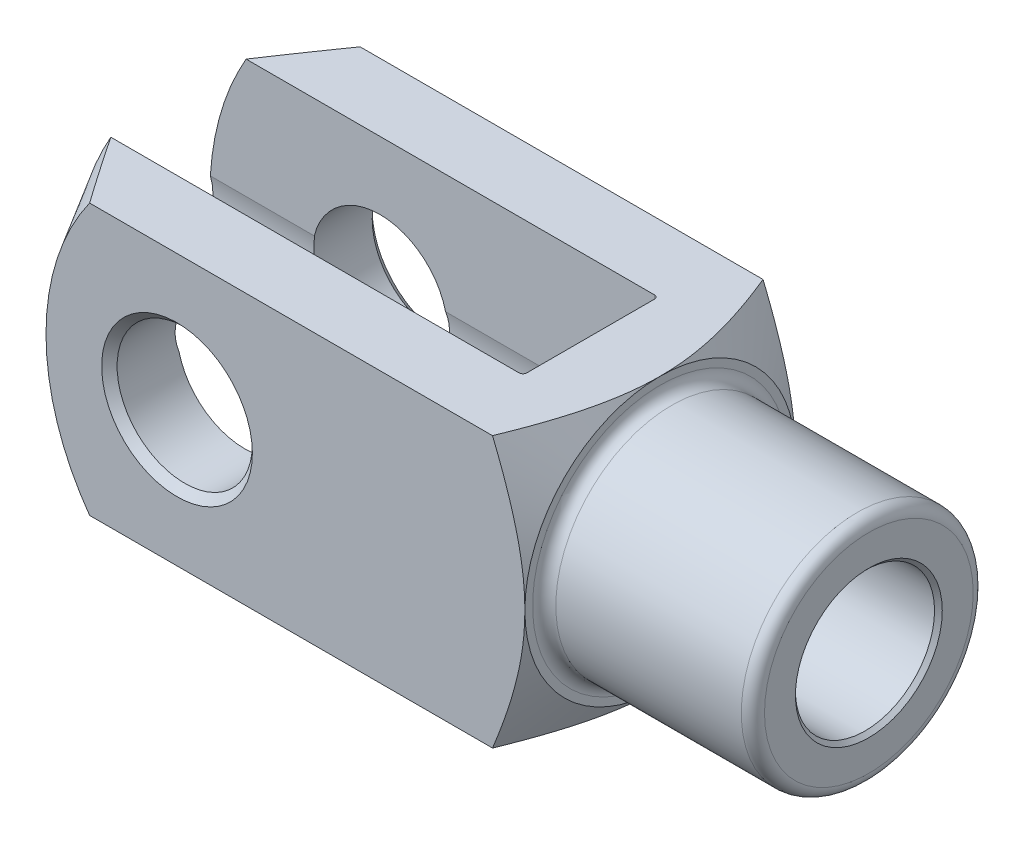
ISO-10303-21;
HEADER;
FILE_DESCRIPTION(('STEP AP214'),'2;1');
FILE_NAME('part.step','',(''),(''),'','','');
FILE_SCHEMA(('AUTOMOTIVE_DESIGN { 1 0 10303 214 1 1 1 1 }'));
ENDSEC;
DATA;
#1=APPLICATION_CONTEXT('core data for automotive mechanical design processes');
#2=APPLICATION_PROTOCOL_DEFINITION('international standard','automotive_design',2000,#1);
#3=PRODUCT_CONTEXT('',#1,'mechanical');
#4=PRODUCT('Part','Part','',(#3));
#5=PRODUCT_RELATED_PRODUCT_CATEGORY('part','',(#4));
#6=PRODUCT_DEFINITION_FORMATION('','',#4);
#7=PRODUCT_DEFINITION_CONTEXT('part definition',#1,'design');
#8=PRODUCT_DEFINITION('design','',#6,#7);
#9=PRODUCT_DEFINITION_SHAPE('','',#8);
#10=(LENGTH_UNIT() NAMED_UNIT(*) SI_UNIT(.MILLI.,.METRE.));
#11=(NAMED_UNIT(*) PLANE_ANGLE_UNIT() SI_UNIT($,.RADIAN.));
#12=(NAMED_UNIT(*) SI_UNIT($,.STERADIAN.) SOLID_ANGLE_UNIT());
#13=UNCERTAINTY_MEASURE_WITH_UNIT(LENGTH_MEASURE(1.E-05),#10,'distance_accuracy_value','');
#14=(GEOMETRIC_REPRESENTATION_CONTEXT(3) GLOBAL_UNCERTAINTY_ASSIGNED_CONTEXT((#13)) GLOBAL_UNIT_ASSIGNED_CONTEXT((#10,
#11,#12)) REPRESENTATION_CONTEXT('',''));
#15=CARTESIAN_POINT('',(0.,0.,0.));
#16=DIRECTION('',(0.,0.,1.));
#17=DIRECTION('',(1.,0.,0.));
#18=AXIS2_PLACEMENT_3D('',#15,#16,#17);
#19=CARTESIAN_POINT('',(-188.,-35.,-17.5));
#20=DIRECTION('',(0.,0.,-1.));
#21=DIRECTION('',(-1.,0.,0.));
#22=AXIS2_PLACEMENT_3D('',#19,#20,#21);
#23=PLANE('',#22);
#24=CARTESIAN_POINT('',(-118.,0.,-17.5));
#25=DIRECTION('',(0.,0.,1.));
#26=DIRECTION('',(1.,0.,0.));
#27=AXIS2_PLACEMENT_3D('',#24,#25,#26);
#28=CIRCLE('',#27,70.);
#29=CARTESIAN_POINT('',(-178.621778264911,35.,-17.5));
#30=VERTEX_POINT('',#29);
#31=CARTESIAN_POINT('',(-187.873099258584,4.21307488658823,-17.5));
#32=VERTEX_POINT('',#31);
#33=EDGE_CURVE('E217',#30,#32,#28,.T.);
#34=ORIENTED_EDGE('',*,*,#33,.T.);
#35=DIRECTION('',(1.,0.,0.));
#36=VECTOR('',#35,1.);
#37=CARTESIAN_POINT('',(-188.,4.21307488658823,-17.5));
#38=LINE('',#37,#36);
#39=CARTESIAN_POINT('',(-160.985287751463,4.21307488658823,-17.5));
#40=VERTEX_POINT('',#39);
#41=EDGE_CURVE('E192',#32,#40,#38,.T.);
#42=ORIENTED_EDGE('',*,*,#41,.T.);
#43=CARTESIAN_POINT('',(-144.,0.,-17.5));
#44=DIRECTION('',(0.,0.,-1.));
#45=DIRECTION('',(-1.,0.,0.));
#46=AXIS2_PLACEMENT_3D('',#43,#44,#45);
#47=CIRCLE('',#46,17.5);
#48=CARTESIAN_POINT('',(-127.014712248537,4.21307488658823,-17.5));
#49=VERTEX_POINT('',#48);
#50=EDGE_CURVE('E626',#49,#40,#47,.F.);
#51=ORIENTED_EDGE('',*,*,#50,.F.);
#52=CARTESIAN_POINT('',(-73.,4.21307488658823,-17.5));
#53=VERTEX_POINT('',#52);
#54=EDGE_CURVE('E324',#49,#53,#38,.T.);
#55=ORIENTED_EDGE('',*,*,#54,.T.);
#56=DIRECTION('',(0.,1.,0.));
#57=VECTOR('',#56,1.);
#58=CARTESIAN_POINT('',(-73.,35.,-17.5));
#59=LINE('',#58,#57);
#60=CARTESIAN_POINT('',(-73.,35.,-17.5));
#61=VERTEX_POINT('',#60);
#62=EDGE_CURVE('E422',#53,#61,#59,.T.);
#63=ORIENTED_EDGE('',*,*,#62,.T.);
#64=DIRECTION('',(-1.,0.,0.));
#65=VECTOR('',#64,1.);
#66=CARTESIAN_POINT('',(-188.,35.,-17.5));
#67=LINE('',#66,#65);
#68=EDGE_CURVE('E656',#61,#30,#67,.T.);
#69=ORIENTED_EDGE('',*,*,#68,.T.);
#70=EDGE_LOOP('',(#34,#42,#51,#55,#63,#69));
#71=FACE_BOUND('',#70,.T.);
#72=ADVANCED_FACE('F37',(#71),#23,.F.);
#73=CARTESIAN_POINT('',(-188.,-35.,17.5));
#74=DIRECTION('',(0.,0.,1.));
#75=DIRECTION('',(1.,0.,0.));
#76=AXIS2_PLACEMENT_3D('',#73,#74,#75);
#77=PLANE('',#76);
#78=CARTESIAN_POINT('',(-118.,0.,17.5));
#79=DIRECTION('',(0.,0.,1.));
#80=DIRECTION('',(1.,0.,0.));
#81=AXIS2_PLACEMENT_3D('',#78,#79,#80);
#82=CIRCLE('',#81,70.);
#83=CARTESIAN_POINT('',(-187.873099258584,-4.21307488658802,17.5));
#84=VERTEX_POINT('',#83);
#85=CARTESIAN_POINT('',(-178.621778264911,-35.,17.5));
#86=VERTEX_POINT('',#85);
#87=EDGE_CURVE('E934',#84,#86,#82,.T.);
#88=ORIENTED_EDGE('',*,*,#87,.F.);
#89=DIRECTION('',(1.,0.,0.));
#90=VECTOR('',#89,1.);
#91=CARTESIAN_POINT('',(-188.,-4.21307488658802,17.5));
#92=LINE('',#91,#90);
#93=CARTESIAN_POINT('',(-160.985287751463,-4.21307488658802,17.5));
#94=VERTEX_POINT('',#93);
#95=EDGE_CURVE('E61',#84,#94,#92,.T.);
#96=ORIENTED_EDGE('',*,*,#95,.T.);
#97=CARTESIAN_POINT('',(-144.,0.,17.5));
#98=DIRECTION('',(0.,0.,1.));
#99=DIRECTION('',(1.,0.,0.));
#100=AXIS2_PLACEMENT_3D('',#97,#98,#99);
#101=CIRCLE('',#100,17.5);
#102=CARTESIAN_POINT('',(-127.014712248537,-4.21307488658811,17.5));
#103=VERTEX_POINT('',#102);
#104=EDGE_CURVE('E622',#103,#94,#101,.F.);
#105=ORIENTED_EDGE('',*,*,#104,.F.);
#106=CARTESIAN_POINT('',(-73.,-4.21307488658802,17.5));
#107=VERTEX_POINT('',#106);
#108=EDGE_CURVE('E287',#103,#107,#92,.T.);
#109=ORIENTED_EDGE('',*,*,#108,.T.);
#110=DIRECTION('',(0.,1.,0.));
#111=VECTOR('',#110,1.);
#112=CARTESIAN_POINT('',(-73.,-35.,17.5));
#113=LINE('',#112,#111);
#114=CARTESIAN_POINT('',(-73.,-35.,17.5));
#115=VERTEX_POINT('',#114);
#116=EDGE_CURVE('E407',#107,#115,#113,.F.);
#117=ORIENTED_EDGE('',*,*,#116,.T.);
#118=DIRECTION('',(1.,0.,0.));
#119=VECTOR('',#118,1.);
#120=CARTESIAN_POINT('',(-188.,-35.,17.5));
#121=LINE('',#120,#119);
#122=EDGE_CURVE('E647',#86,#115,#121,.T.);
#123=ORIENTED_EDGE('',*,*,#122,.F.);
#124=EDGE_LOOP('',(#88,#96,#105,#109,#117,#123));
#125=FACE_BOUND('',#124,.T.);
#126=ADVANCED_FACE('F384',(#125),#77,.F.);
#127=CARTESIAN_POINT('',(-73.,-35.,-16.5));
#128=DIRECTION('',(0.,-1.,0.));
#129=DIRECTION('',(0.,0.,-1.));
#130=AXIS2_PLACEMENT_3D('',#127,#128,#129);
#131=CYLINDRICAL_SURFACE('',#130,1.);
#132=DIRECTION('',(0.,1.,0.));
#133=VECTOR('',#132,1.);
#134=CARTESIAN_POINT('',(-72.,-35.,-16.5));
#135=LINE('',#134,#133);
#136=CARTESIAN_POINT('',(-72.,-7.19374728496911,-16.5));
#137=VERTEX_POINT('',#136);
#138=CARTESIAN_POINT('',(-72.,-35.,-16.5));
#139=VERTEX_POINT('',#138);
#140=EDGE_CURVE('E614',#137,#139,#135,.F.);
#141=ORIENTED_EDGE('',*,*,#140,.F.);
#142=CARTESIAN_POINT('',(-72.,-7.19374728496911,-16.5));
#143=CARTESIAN_POINT('',(-72.0000131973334,-7.11650112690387,-16.5336792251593));
#144=CARTESIAN_POINT('',(-72.0017010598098,-7.03902736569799,-16.5668099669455));
#145=CARTESIAN_POINT('',(-72.0081979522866,-6.88374477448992,-16.631931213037));
#146=CARTESIAN_POINT('',(-72.0130065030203,-6.80593599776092,-16.6639218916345));
#147=CARTESIAN_POINT('',(-72.0255252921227,-6.64997334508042,-16.7267729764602));
#148=CARTESIAN_POINT('',(-72.0332394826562,-6.57181914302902,-16.7576317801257));
#149=CARTESIAN_POINT('',(-72.0514330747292,-6.41537083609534,-16.8181466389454));
#150=CARTESIAN_POINT('',(-72.0619125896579,-6.33707672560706,-16.8478026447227));
#151=CARTESIAN_POINT('',(-72.0975002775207,-6.10110867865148,-16.9353095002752));
#152=CARTESIAN_POINT('',(-72.1266769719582,-5.94332461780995,-16.9913062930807));
#153=CARTESIAN_POINT('',(-72.1787390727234,-5.70728135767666,-17.0714338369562));
#154=CARTESIAN_POINT('',(-72.1974693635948,-5.62872826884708,-17.0974914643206));
#155=CARTESIAN_POINT('',(-72.2379230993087,-5.471973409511,-17.1483027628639));
#156=CARTESIAN_POINT('',(-72.2596461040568,-5.39377158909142,-17.17305662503));
#157=CARTESIAN_POINT('',(-72.3036354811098,-5.24742606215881,-17.2182941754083));
#158=CARTESIAN_POINT('',(-72.3255157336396,-5.17921383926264,-17.2389314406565));
#159=CARTESIAN_POINT('',(-72.3723270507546,-5.04361615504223,-17.2790891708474));
#160=CARTESIAN_POINT('',(-72.3972535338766,-4.97622961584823,-17.2986112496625));
#161=CARTESIAN_POINT('',(-72.4429187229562,-4.86277710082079,-17.3307748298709));
#162=CARTESIAN_POINT('',(-72.462660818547,-4.8163967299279,-17.3437192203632));
#163=CARTESIAN_POINT('',(-72.5045668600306,-4.72444426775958,-17.3689924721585));
#164=CARTESIAN_POINT('',(-72.5267351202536,-4.67887378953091,-17.3813201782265));
#165=CARTESIAN_POINT('',(-72.5750180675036,-4.58766965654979,-17.4056195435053));
#166=CARTESIAN_POINT('',(-72.6012408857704,-4.54208601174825,-17.4175650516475));
#167=CARTESIAN_POINT('',(-72.6584179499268,-4.45374001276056,-17.4403625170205));
#168=CARTESIAN_POINT('',(-72.6893539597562,-4.41096765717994,-17.4512184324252));
#169=CARTESIAN_POINT('',(-72.7382377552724,-4.35495179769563,-17.4652421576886));
#170=CARTESIAN_POINT('',(-72.7530557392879,-4.33919674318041,-17.4691617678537));
#171=CARTESIAN_POINT('',(-72.7843175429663,-4.30915314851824,-17.4765968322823));
#172=CARTESIAN_POINT('',(-72.8007657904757,-4.29486882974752,-17.4801111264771));
#173=CARTESIAN_POINT('',(-72.8358695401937,-4.26835902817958,-17.4866034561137));
#174=CARTESIAN_POINT('',(-72.8545594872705,-4.25617530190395,-17.4895706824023));
#175=CARTESIAN_POINT('',(-72.8939752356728,-4.23563034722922,-17.4945576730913));
#176=CARTESIAN_POINT('',(-72.9146820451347,-4.22723699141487,-17.4965854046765));
#177=CARTESIAN_POINT('',(-72.946488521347,-4.21879874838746,-17.4986212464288));
#178=CARTESIAN_POINT('',(-72.9570132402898,-4.21668135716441,-17.4991314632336));
#179=CARTESIAN_POINT('',(-72.9783511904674,-4.21380665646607,-17.4998238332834));
#180=CARTESIAN_POINT('',(-72.9891661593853,-4.21306166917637,-17.5000030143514));
#181=CARTESIAN_POINT('',(-72.9999999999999,-4.21307488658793,-17.5000000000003));
#182=B_SPLINE_CURVE_WITH_KNOTS('',3,(#142,#143,#144,#145,#146,#147,#148,#149,#150,#151,#152,
#153,#154,#155,#156,#157,#158,#159,#160,#161,#162,#163,#164,#165,#166,#167,#168,#169,#170,#171,
#172,#173,#174,#175,#176,#177,#178,#179,#180,#181),.UNSPECIFIED.,.F.,.F.,(4,2,2,2,2,2,2,2,2,2,2,
2,2,2,2,2,2,2,2,4),(0.,0.252772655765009,0.505506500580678,0.758585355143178,1.01167458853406,
1.52101108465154,1.77553281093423,2.0300171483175,2.25360699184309,2.47686460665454,
2.63294713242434,2.78931186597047,2.95096606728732,3.11200998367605,3.17787365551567,
3.24392139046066,3.31115976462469,3.37781700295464,3.40997218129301,3.44241468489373),.UNSPECIFIED.);
#183=CARTESIAN_POINT('',(-73.,-4.21307488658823,-17.5));
#184=VERTEX_POINT('',#183);
#185=EDGE_CURVE('E344',#137,#184,#182,.T.);
#186=ORIENTED_EDGE('',*,*,#185,.T.);
#187=CARTESIAN_POINT('',(-73.,-35.,-17.5));
#188=VERTEX_POINT('',#187);
#189=EDGE_CURVE('E428',#188,#184,#59,.T.);
#190=ORIENTED_EDGE('',*,*,#189,.F.);
#191=CARTESIAN_POINT('',(-73.,-35.,-16.5));
#192=DIRECTION('',(0.,-1.,0.));
#193=DIRECTION('',(0.,0.,-1.));
#194=AXIS2_PLACEMENT_3D('',#191,#192,#193);
#195=CIRCLE('',#194,1.);
#196=EDGE_CURVE('E440',#139,#188,#195,.F.);
#197=ORIENTED_EDGE('',*,*,#196,.F.);
#198=EDGE_LOOP('',(#141,#186,#190,#197));
#199=FACE_BOUND('',#198,.T.);
#200=ADVANCED_FACE('F363',(#199),#131,.F.);
#201=CARTESIAN_POINT('',(-72.,-35.,-17.5));
#202=DIRECTION('',(1.,0.,0.));
#203=DIRECTION('',(0.,0.,-1.));
#204=AXIS2_PLACEMENT_3D('',#201,#202,#203);
#205=PLANE('',#204);
#206=CARTESIAN_POINT('',(-72.,35.,-16.5));
#207=VERTEX_POINT('',#206);
#208=CARTESIAN_POINT('',(-72.,7.19374728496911,-16.5));
#209=VERTEX_POINT('',#208);
#210=EDGE_CURVE('E629',#207,#209,#135,.F.);
#211=ORIENTED_EDGE('',*,*,#210,.T.);
#212=CARTESIAN_POINT('',(-72.,0.,0.));
#213=DIRECTION('',(1.,0.,0.));
#214=DIRECTION('',(0.,0.,-1.));
#215=AXIS2_PLACEMENT_3D('',#212,#213,#214);
#216=CIRCLE('',#215,18.);
#217=CARTESIAN_POINT('',(-72.,7.19374728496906,16.5));
#218=VERTEX_POINT('',#217);
#219=EDGE_CURVE('E927',#209,#218,#216,.T.);
#220=ORIENTED_EDGE('',*,*,#219,.T.);
#221=DIRECTION('',(0.,1.,0.));
#222=VECTOR('',#221,1.);
#223=CARTESIAN_POINT('',(-72.,35.,16.5));
#224=LINE('',#223,#222);
#225=CARTESIAN_POINT('',(-72.,35.,16.5));
#226=VERTEX_POINT('',#225);
#227=EDGE_CURVE('E424',#218,#226,#224,.T.);
#228=ORIENTED_EDGE('',*,*,#227,.T.);
#229=DIRECTION('',(0.,0.,-1.));
#230=VECTOR('',#229,1.);
#231=CARTESIAN_POINT('',(-72.,35.,-17.5));
#232=LINE('',#231,#230);
#233=EDGE_CURVE('E651',#226,#207,#232,.T.);
#234=ORIENTED_EDGE('',*,*,#233,.T.);
#235=EDGE_LOOP('',(#211,#220,#228,#234));
#236=FACE_BOUND('',#235,.T.);
#237=ADVANCED_FACE('F398',(#236),#205,.F.);
#238=CARTESIAN_POINT('',(-73.,-35.,16.5));
#239=DIRECTION('',(0.,-1.,0.));
#240=DIRECTION('',(0.,0.,-1.));
#241=AXIS2_PLACEMENT_3D('',#238,#239,#240);
#242=CYLINDRICAL_SURFACE('',#241,1.);
#243=ORIENTED_EDGE('',*,*,#116,.F.);
#244=CARTESIAN_POINT('',(-73.,-4.21307488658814,17.5));
#245=CARTESIAN_POINT('',(-72.9829605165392,-4.21300539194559,17.5000159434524));
#246=CARTESIAN_POINT('',(-72.966041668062,-4.21488071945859,17.4995653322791));
#247=CARTESIAN_POINT('',(-72.9332135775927,-4.22180791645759,17.4978957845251));
#248=CARTESIAN_POINT('',(-72.9172915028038,-4.22680083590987,17.4966911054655));
#249=CARTESIAN_POINT('',(-72.8827128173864,-4.2408627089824,17.4932885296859));
#250=CARTESIAN_POINT('',(-72.8643720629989,-4.2506399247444,17.4909172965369));
#251=CARTESIAN_POINT('',(-72.8293871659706,-4.27287975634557,17.485497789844));
#252=CARTESIAN_POINT('',(-72.8127570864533,-4.28536235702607,17.4824444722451));
#253=CARTESIAN_POINT('',(-72.7666754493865,-4.32419460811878,17.4728937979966));
#254=CARTESIAN_POINT('',(-72.7393159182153,-4.35283241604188,17.4657893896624));
#255=CARTESIAN_POINT('',(-72.6886163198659,-4.41314085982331,17.4506496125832));
#256=CARTESIAN_POINT('',(-72.6652849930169,-4.44481786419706,17.4426122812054));
#257=CARTESIAN_POINT('',(-72.624182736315,-4.50591953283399,17.4269205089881));
#258=CARTESIAN_POINT('',(-72.6060808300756,-4.53514285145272,17.4193403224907));
#259=CARTESIAN_POINT('',(-72.5715900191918,-4.5944878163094,17.4037819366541));
#260=CARTESIAN_POINT('',(-72.5552020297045,-4.62460993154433,17.3958035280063));
#261=CARTESIAN_POINT('',(-72.5080240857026,-4.7160047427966,17.3713347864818));
#262=CARTESIAN_POINT('',(-72.4792876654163,-4.77819895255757,17.3543383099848));
#263=CARTESIAN_POINT('',(-72.4254389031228,-4.90441873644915,17.31909410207));
#264=CARTESIAN_POINT('',(-72.4003599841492,-4.96845548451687,17.300836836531));
#265=CARTESIAN_POINT('',(-72.3532834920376,-5.09727188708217,17.2633228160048));
#266=CARTESIAN_POINT('',(-72.3312826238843,-5.16205066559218,17.2440671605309));
#267=CARTESIAN_POINT('',(-72.2840320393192,-5.31025061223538,17.1990927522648));
#268=CARTESIAN_POINT('',(-72.2595865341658,-5.39383430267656,17.1730687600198));
#269=CARTESIAN_POINT('',(-72.2142284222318,-5.56148672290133,17.1195097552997));
#270=CARTESIAN_POINT('',(-72.1933165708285,-5.64555555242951,17.0919744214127));
#271=CARTESIAN_POINT('',(-72.1547052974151,-5.81404572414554,17.0353978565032));
#272=CARTESIAN_POINT('',(-72.1370099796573,-5.89846737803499,17.0063547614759));
#273=CARTESIAN_POINT('',(-72.1047361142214,-6.0673959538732,16.9468205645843));
#274=CARTESIAN_POINT('',(-72.0901575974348,-6.15190287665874,16.916329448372));
#275=CARTESIAN_POINT('',(-72.06476976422,-6.31661868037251,16.8554929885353));
#276=CARTESIAN_POINT('',(-72.0538076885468,-6.39682984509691,16.8252175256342));
#277=CARTESIAN_POINT('',(-72.034773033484,-6.55710563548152,16.7634048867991));
#278=CARTESIAN_POINT('',(-72.0267003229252,-6.63717026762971,16.7318677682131));
#279=CARTESIAN_POINT('',(-72.013606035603,-6.79686678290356,16.6676329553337));
#280=CARTESIAN_POINT('',(-72.0085773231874,-6.87649924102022,16.634938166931));
#281=CARTESIAN_POINT('',(-72.0017814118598,-7.03541654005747,16.5683538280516));
#282=CARTESIAN_POINT('',(-72.0000147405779,-7.11470132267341,16.5344640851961));
#283=CARTESIAN_POINT('',(-72.,-7.19374728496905,16.5));
#284=B_SPLINE_CURVE_WITH_KNOTS('',3,(#244,#245,#246,#247,#248,#249,#250,#251,#252,#253,#254,
#255,#256,#257,#258,#259,#260,#261,#262,#263,#264,#265,#266,#267,#268,#269,#270,#271,#272,#273,
#274,#275,#276,#277,#278,#279,#280,#281,#282,#283),.UNSPECIFIED.,.F.,.F.,(4,2,2,2,2,2,2,2,2,2,2,
2,2,2,2,2,2,2,2,4),(0.,0.0508178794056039,0.100702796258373,0.16310045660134,0.225975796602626,
0.346025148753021,0.46633179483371,0.571859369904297,0.677443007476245,0.888996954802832,
1.10237697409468,1.31552679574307,1.58809983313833,1.86073106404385,2.13370776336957,
2.406687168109,2.6659293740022,2.92515980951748,3.18378018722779,3.44244239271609),.UNSPECIFIED.);
#285=CARTESIAN_POINT('',(-72.,-7.19374728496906,16.5));
#286=VERTEX_POINT('',#285);
#287=EDGE_CURVE('E336',#107,#286,#284,.T.);
#288=ORIENTED_EDGE('',*,*,#287,.T.);
#289=CARTESIAN_POINT('',(-72.,-35.,16.5));
#290=VERTEX_POINT('',#289);
#291=EDGE_CURVE('E416',#290,#286,#224,.T.);
#292=ORIENTED_EDGE('',*,*,#291,.F.);
#293=CARTESIAN_POINT('',(-73.,-35.,16.5));
#294=DIRECTION('',(0.,-1.,0.));
#295=DIRECTION('',(0.,0.,-1.));
#296=AXIS2_PLACEMENT_3D('',#293,#294,#295);
#297=CIRCLE('',#296,1.);
#298=EDGE_CURVE('E410',#115,#290,#297,.F.);
#299=ORIENTED_EDGE('',*,*,#298,.F.);
#300=EDGE_LOOP('',(#243,#288,#292,#299));
#301=FACE_BOUND('',#300,.T.);
#302=ADVANCED_FACE('F354',(#301),#242,.F.);
#303=ORIENTED_EDGE('',*,*,#189,.T.);
#304=DIRECTION('',(1.,0.,0.));
#305=VECTOR('',#304,1.);
#306=CARTESIAN_POINT('',(-188.,-4.21307488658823,-17.5));
#307=LINE('',#306,#305);
#308=CARTESIAN_POINT('',(-127.014712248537,-4.21307488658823,-17.5));
#309=VERTEX_POINT('',#308);
#310=EDGE_CURVE('E211',#184,#309,#307,.F.);
#311=ORIENTED_EDGE('',*,*,#310,.T.);
#312=CARTESIAN_POINT('',(-160.985287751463,-4.21307488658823,-17.5));
#313=VERTEX_POINT('',#312);
#314=EDGE_CURVE('E208',#313,#309,#47,.F.);
#315=ORIENTED_EDGE('',*,*,#314,.F.);
#316=CARTESIAN_POINT('',(-187.873099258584,-4.21307488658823,-17.5));
#317=VERTEX_POINT('',#316);
#318=EDGE_CURVE('E189',#313,#317,#307,.F.);
#319=ORIENTED_EDGE('',*,*,#318,.T.);
#320=CARTESIAN_POINT('',(-178.621778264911,-35.,-17.5));
#321=VERTEX_POINT('',#320);
#322=EDGE_CURVE('E204',#317,#321,#28,.T.);
#323=ORIENTED_EDGE('',*,*,#322,.T.);
#324=DIRECTION('',(-1.,0.,0.));
#325=VECTOR('',#324,1.);
#326=CARTESIAN_POINT('',(-188.,-35.,-17.5));
#327=LINE('',#326,#325);
#328=EDGE_CURVE('E552',#188,#321,#327,.T.);
#329=ORIENTED_EDGE('',*,*,#328,.F.);
#330=EDGE_LOOP('',(#303,#311,#315,#319,#323,#329));
#331=FACE_BOUND('',#330,.T.);
#332=ADVANCED_FACE('F202',(#331),#23,.F.);
#333=CARTESIAN_POINT('',(-73.,35.,17.5));
#334=VERTEX_POINT('',#333);
#335=CARTESIAN_POINT('',(-73.,4.21307488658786,17.5));
#336=VERTEX_POINT('',#335);
#337=EDGE_CURVE('E415',#334,#336,#113,.F.);
#338=ORIENTED_EDGE('',*,*,#337,.T.);
#339=DIRECTION('',(1.,0.,0.));
#340=VECTOR('',#339,1.);
#341=CARTESIAN_POINT('',(-188.,4.21307488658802,17.5));
#342=LINE('',#341,#340);
#343=CARTESIAN_POINT('',(-127.014712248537,4.21307488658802,17.5));
#344=VERTEX_POINT('',#343);
#345=EDGE_CURVE('E53',#336,#344,#342,.F.);
#346=ORIENTED_EDGE('',*,*,#345,.T.);
#347=CARTESIAN_POINT('',(-160.985287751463,4.21307488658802,17.5));
#348=VERTEX_POINT('',#347);
#349=EDGE_CURVE('E627',#348,#344,#101,.F.);
#350=ORIENTED_EDGE('',*,*,#349,.F.);
#351=CARTESIAN_POINT('',(-187.873099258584,4.21307488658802,17.5));
#352=VERTEX_POINT('',#351);
#353=EDGE_CURVE('E274',#348,#352,#342,.F.);
#354=ORIENTED_EDGE('',*,*,#353,.T.);
#355=CARTESIAN_POINT('',(-178.621778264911,35.,17.5));
#356=VERTEX_POINT('',#355);
#357=EDGE_CURVE('E935',#356,#352,#82,.T.);
#358=ORIENTED_EDGE('',*,*,#357,.F.);
#359=DIRECTION('',(1.,0.,0.));
#360=VECTOR('',#359,1.);
#361=CARTESIAN_POINT('',(-188.,35.,17.5));
#362=LINE('',#361,#360);
#363=EDGE_CURVE('E653',#356,#334,#362,.T.);
#364=ORIENTED_EDGE('',*,*,#363,.T.);
#365=EDGE_LOOP('',(#338,#346,#350,#354,#358,#364));
#366=FACE_BOUND('',#365,.T.);
#367=ADVANCED_FACE('F390',(#366),#77,.F.);
#368=CARTESIAN_POINT('',(-188.,-35.,35.));
#369=DIRECTION('',(0.,0.,1.));
#370=DIRECTION('',(1.,0.,0.));
#371=AXIS2_PLACEMENT_3D('',#368,#369,#370);
#372=PLANE('',#371);
#373=CARTESIAN_POINT('',(-144.,0.,35.));
#374=DIRECTION('',(0.,0.,1.));
#375=DIRECTION('',(1.,0.,0.));
#376=AXIS2_PLACEMENT_3D('',#373,#374,#375);
#377=CIRCLE('',#376,19.5);
#378=CARTESIAN_POINT('',(-124.5,0.,35.));
#379=VERTEX_POINT('',#378);
#380=EDGE_CURVE('E471',#379,#379,#377,.F.);
#381=ORIENTED_EDGE('',*,*,#380,.T.);
#382=EDGE_LOOP('',(#381));
#383=FACE_BOUND('',#382,.T.);
#384=DIRECTION('',(1.,0.,0.));
#385=VECTOR('',#384,1.);
#386=CARTESIAN_POINT('',(-188.,35.,35.));
#387=LINE('',#386,#385);
#388=CARTESIAN_POINT('',(-166.606328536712,35.,35.));
#389=VERTEX_POINT('',#388);
#390=CARTESIAN_POINT('',(-62.3701209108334,35.,35.));
#391=VERTEX_POINT('',#390);
#392=EDGE_CURVE('E592',#389,#391,#387,.T.);
#393=ORIENTED_EDGE('',*,*,#392,.F.);
#394=CARTESIAN_POINT('',(-118.,0.,35.));
#395=DIRECTION('',(0.,0.,1.));
#396=DIRECTION('',(1.,0.,0.));
#397=AXIS2_PLACEMENT_3D('',#394,#395,#396);
#398=CIRCLE('',#397,59.8963702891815);
#399=CARTESIAN_POINT('',(-166.606328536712,-35.,35.));
#400=VERTEX_POINT('',#399);
#401=EDGE_CURVE('E225',#389,#400,#398,.T.);
#402=ORIENTED_EDGE('',*,*,#401,.T.);
#403=DIRECTION('',(1.,0.,0.));
#404=VECTOR('',#403,1.);
#405=CARTESIAN_POINT('',(-188.,-35.,35.));
#406=LINE('',#405,#404);
#407=CARTESIAN_POINT('',(-62.3701209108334,-35.,35.));
#408=VERTEX_POINT('',#407);
#409=EDGE_CURVE('E599',#400,#408,#406,.T.);
#410=ORIENTED_EDGE('',*,*,#409,.T.);
#411=CARTESIAN_POINT('',(-79.7455571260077,-71.4841524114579,35.));
#412=CARTESIAN_POINT('',(-79.2983354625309,-70.6216687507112,35.));
#413=CARTESIAN_POINT('',(-78.8523395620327,-69.7585498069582,35.));
#414=CARTESIAN_POINT('',(-77.9630613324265,-68.0309117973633,35.));
#415=CARTESIAN_POINT('',(-77.5197790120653,-67.1663927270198,35.));
#416=CARTESIAN_POINT('',(-76.1943552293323,-64.5704620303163,35.));
#417=CARTESIAN_POINT('',(-75.3166821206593,-62.8367639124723,35.));
#418=CARTESIAN_POINT('',(-73.5744168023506,-59.3590234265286,35.));
#419=CARTESIAN_POINT('',(-72.7098500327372,-57.6149683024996,35.));
#420=CARTESIAN_POINT('',(-70.9988898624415,-54.1179792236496,35.));
#421=CARTESIAN_POINT('',(-70.1524961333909,-52.3650454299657,35.));
#422=CARTESIAN_POINT('',(-68.8743862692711,-49.673396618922,35.));
#423=CARTESIAN_POINT('',(-68.4344483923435,-48.7385836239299,35.));
#424=CARTESIAN_POINT('',(-67.5619188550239,-46.865537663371,35.));
#425=CARTESIAN_POINT('',(-67.1293271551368,-45.9273047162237,35.));
#426=CARTESIAN_POINT('',(-66.2724882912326,-44.0469670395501,35.));
#427=CARTESIAN_POINT('',(-65.8482416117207,-43.1048620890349,35.));
#428=CARTESIAN_POINT('',(-65.0093315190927,-41.2163859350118,35.));
#429=CARTESIAN_POINT('',(-64.594668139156,-40.2700147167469,35.));
#430=CARTESIAN_POINT('',(-63.7765361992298,-38.3729279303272,35.));
#431=CARTESIAN_POINT('',(-63.3730628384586,-37.4222144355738,35.));
#432=CARTESIAN_POINT('',(-62.5788187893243,-35.5154994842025,35.));
#433=CARTESIAN_POINT('',(-62.1880479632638,-34.5594980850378,35.));
#434=CARTESIAN_POINT('',(-61.4212481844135,-32.6417187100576,35.));
#435=CARTESIAN_POINT('',(-61.0452174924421,-31.6799414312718,35.));
#436=CARTESIAN_POINT('',(-60.3101986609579,-29.7498374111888,35.));
#437=CARTESIAN_POINT('',(-59.9512112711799,-28.781510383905,35.));
#438=CARTESIAN_POINT('',(-59.1773660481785,-26.6269700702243,35.));
#439=CARTESIAN_POINT('',(-58.7672704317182,-25.4390360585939,35.));
#440=CARTESIAN_POINT('',(-57.9823694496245,-23.0516177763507,35.));
#441=CARTESIAN_POINT('',(-57.6075610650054,-21.8521345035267,35.));
#442=CARTESIAN_POINT('',(-56.9001918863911,-19.4407071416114,35.));
#443=CARTESIAN_POINT('',(-56.5676302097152,-18.2287633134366,35.));
#444=CARTESIAN_POINT('',(-55.9526962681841,-15.79212691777,35.));
#445=CARTESIAN_POINT('',(-55.6703234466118,-14.5674344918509,35.));
#446=CARTESIAN_POINT('',(-55.1702230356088,-12.1346782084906,35.));
#447=CARTESIAN_POINT('',(-54.9511335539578,-10.926898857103,35.));
#448=CARTESIAN_POINT('',(-54.6702587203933,-9.10791584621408,35.));
#449=CARTESIAN_POINT('',(-54.5845910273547,-8.50034299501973,35.));
#450=CARTESIAN_POINT('',(-54.4300119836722,-7.28307909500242,35.));
#451=CARTESIAN_POINT('',(-54.3610998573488,-6.67338814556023,35.));
#452=CARTESIAN_POINT('',(-54.2408047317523,-5.45265711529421,35.));
#453=CARTESIAN_POINT('',(-54.1894109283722,-4.84161810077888,35.));
#454=CARTESIAN_POINT('',(-54.1046686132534,-3.61828422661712,35.));
#455=CARTESIAN_POINT('',(-54.0713201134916,-3.00598936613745,35.));
#456=CARTESIAN_POINT('',(-54.0230583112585,-1.78068731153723,35.));
#457=CARTESIAN_POINT('',(-54.0081445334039,-1.16768013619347,35.));
#458=CARTESIAN_POINT('',(-53.9969287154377,0.0585026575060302,35.));
#459=CARTESIAN_POINT('',(-54.0006265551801,0.67167827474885,35.));
#460=CARTESIAN_POINT('',(-54.0256414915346,1.85294442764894,35.));
#461=CARTESIAN_POINT('',(-54.0456545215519,2.42106307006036,35.));
#462=CARTESIAN_POINT('',(-54.1014333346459,3.55654632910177,35.));
#463=CARTESIAN_POINT('',(-54.1371997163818,4.12391091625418,35.));
#464=CARTESIAN_POINT('',(-54.2241302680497,5.25742922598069,35.));
#465=CARTESIAN_POINT('',(-54.2752936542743,5.82358300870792,35.));
#466=CARTESIAN_POINT('',(-54.3925261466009,6.95435287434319,35.));
#467=CARTESIAN_POINT('',(-54.4585958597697,7.51896889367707,35.));
#468=CARTESIAN_POINT('',(-54.6783609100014,9.21054236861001,35.));
#469=CARTESIAN_POINT('',(-54.8535756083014,10.3347599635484,35.));
#470=CARTESIAN_POINT('',(-55.2556333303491,12.5738033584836,35.));
#471=CARTESIAN_POINT('',(-55.4824777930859,13.6886288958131,35.));
#472=CARTESIAN_POINT('',(-55.9887006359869,15.94014365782,35.));
#473=CARTESIAN_POINT('',(-56.2694095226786,17.0765317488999,35.));
#474=CARTESIAN_POINT('',(-56.8720367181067,19.3382710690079,35.));
#475=CARTESIAN_POINT('',(-57.1939554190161,20.4636221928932,35.));
#476=CARTESIAN_POINT('',(-57.703069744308,22.1435871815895,35.));
#477=CARTESIAN_POINT('',(-57.8771454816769,22.7022267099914,35.));
#478=CARTESIAN_POINT('',(-58.2333547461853,23.8169352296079,35.));
#479=CARTESIAN_POINT('',(-58.4154882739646,24.3730042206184,35.));
#480=CARTESIAN_POINT('',(-58.7871408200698,25.4826284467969,35.));
#481=CARTESIAN_POINT('',(-58.9766594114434,26.0361838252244,35.));
#482=CARTESIAN_POINT('',(-59.362488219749,27.1409163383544,35.));
#483=CARTESIAN_POINT('',(-59.5587984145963,27.6920934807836,35.));
#484=CARTESIAN_POINT('',(-60.1895678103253,29.4318816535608,35.));
#485=CARTESIAN_POINT('',(-60.6354807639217,30.6163513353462,35.));
#486=CARTESIAN_POINT('',(-61.5515172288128,32.9759195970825,35.));
#487=CARTESIAN_POINT('',(-62.0216421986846,34.1510176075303,35.));
#488=CARTESIAN_POINT('',(-62.982193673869,36.4931780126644,35.));
#489=CARTESIAN_POINT('',(-63.4726247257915,37.6602385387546,35.));
#490=CARTESIAN_POINT('',(-64.4704100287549,39.9870590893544,35.));
#491=CARTESIAN_POINT('',(-64.9777639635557,41.1468192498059,35.));
#492=CARTESIAN_POINT('',(-66.0071895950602,43.4609776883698,35.));
#493=CARTESIAN_POINT('',(-66.5292736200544,44.6153704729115,35.));
#494=CARTESIAN_POINT('',(-67.5855656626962,46.9185930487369,35.));
#495=CARTESIAN_POINT('',(-68.1197737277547,48.0674228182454,35.));
#496=CARTESIAN_POINT('',(-69.1984683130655,50.36008259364,35.));
#497=CARTESIAN_POINT('',(-69.74295366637,51.5039131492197,35.));
#498=CARTESIAN_POINT('',(-70.8407931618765,53.7873038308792,35.));
#499=CARTESIAN_POINT('',(-71.3941472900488,54.9268639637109,35.));
#500=CARTESIAN_POINT('',(-72.5102077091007,57.2056982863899,35.));
#501=CARTESIAN_POINT('',(-73.0729373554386,58.3449610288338,35.));
#502=CARTESIAN_POINT('',(-74.2050779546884,60.620159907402,35.));
#503=CARTESIAN_POINT('',(-74.774488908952,61.7560960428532,35.));
#504=CARTESIAN_POINT('',(-75.919147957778,64.0250497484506,35.));
#505=CARTESIAN_POINT('',(-76.4943961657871,65.1580672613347,35.));
#506=CARTESIAN_POINT('',(-77.6500048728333,67.4214931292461,35.));
#507=CARTESIAN_POINT('',(-78.2303653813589,68.5519014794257,35.));
#508=CARTESIAN_POINT('',(-79.9775989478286,71.9385331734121,35.));
#509=CARTESIAN_POINT('',(-81.151193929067,74.1912896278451,35.));
#510=CARTESIAN_POINT('',(-83.512438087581,78.6893897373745,35.));
#511=CARTESIAN_POINT('',(-84.7000871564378,80.934733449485,35.));
#512=CARTESIAN_POINT('',(-86.9094378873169,85.0864160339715,35.));
#513=CARTESIAN_POINT('',(-87.9295909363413,86.9935796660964,35.));
#514=CARTESIAN_POINT('',(-89.9767304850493,90.8042363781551,35.));
#515=CARTESIAN_POINT('',(-91.0037169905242,92.7077294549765,35.));
#516=CARTESIAN_POINT('',(-93.0635983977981,96.5118602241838,35.));
#517=CARTESIAN_POINT('',(-94.0964941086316,98.4124974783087,35.));
#518=CARTESIAN_POINT('',(-96.1671930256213,102.211097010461,35.));
#519=CARTESIAN_POINT('',(-97.2049962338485,104.109059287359,35.));
#520=CARTESIAN_POINT('',(-99.2788542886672,107.891810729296,35.));
#521=CARTESIAN_POINT('',(-100.314885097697,109.776613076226,35.));
#522=CARTESIAN_POINT('',(-102.390544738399,113.544235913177,35.));
#523=CARTESIAN_POINT('',(-103.430173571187,115.427056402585,35.));
#524=CARTESIAN_POINT('',(-105.51239361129,119.190669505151,35.));
#525=CARTESIAN_POINT('',(-106.55498432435,121.071462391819,35.));
#526=CARTESIAN_POINT('',(-108.642913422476,124.831519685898,35.));
#527=CARTESIAN_POINT('',(-109.68825180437,126.710784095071,35.));
#528=CARTESIAN_POINT('',(-110.734776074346,128.589387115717,35.));
#529=B_SPLINE_CURVE_WITH_KNOTS('',3,(#411,#412,#413,#414,#415,#416,#417,#418,#419,#420,#421,
#422,#423,#424,#425,#426,#427,#428,#429,#430,#431,#432,#433,#434,#435,#436,#437,#438,#439,#440,
#441,#442,#443,#444,#445,#446,#447,#448,#449,#450,#451,#452,#453,#454,#455,#456,#457,#458,#459,
#460,#461,#462,#463,#464,#465,#466,#467,#468,#469,#470,#471,#472,#473,#474,#475,#476,#477,#478,
#479,#480,#481,#482,#483,#484,#485,#486,#487,#488,#489,#490,#491,#492,#493,#494,#495,#496,#497,
#498,#499,#500,#501,#502,#503,#504,#505,#506,#507,#508,#509,#510,#511,#512,#513,#514,#515,#516,
#517,#518,#519,#520,#521,#522,#523,#524,#525,#526,#527,#528),.UNSPECIFIED.,.F.,.F.,(4,2,2,2,2,2,
2,2,2,2,2,2,2,2,2,2,2,2,2,2,2,2,2,2,2,2,2,2,2,2,2,2,2,2,2,2,2,2,2,2,2,2,2,2,2,2,2,2,2,2,2,2,2,2,
2,2,2,2,4),(0.,2.91461071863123,5.82923082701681,11.6587651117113,17.4984507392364,
23.3380307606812,26.437486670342,29.5369259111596,32.6365445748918,35.7361739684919,
38.8344523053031,41.9326970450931,45.0305751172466,48.128589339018,51.8983063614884,
55.6677005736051,59.4370160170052,63.206289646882,66.8870829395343,68.7276372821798,
70.5681064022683,72.4074383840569,74.2467715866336,76.0860573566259,77.9253312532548,
79.6305250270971,81.3357836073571,83.0409554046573,84.7461966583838,88.1580776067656,
91.5700536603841,95.0807863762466,98.5915525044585,100.346902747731,102.102253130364,
103.857502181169,105.6127455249,109.409260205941,113.206003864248,117.003602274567,
120.801129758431,124.601935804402,128.402756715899,132.203148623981,136.003534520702,
139.815498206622,143.627462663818,147.439501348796,151.251547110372,158.871851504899,
166.492097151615,172.980676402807,179.469261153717,185.958756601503,192.448254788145,
198.900579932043,205.352907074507,211.804214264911,218.255514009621),.UNSPECIFIED.);
#530=CARTESIAN_POINT('',(-54.,0.,35.));
#531=VERTEX_POINT('',#530);
#532=EDGE_CURVE('E563',#531,#408,#529,.F.);
#533=ORIENTED_EDGE('',*,*,#532,.F.);
#534=EDGE_CURVE('E573',#391,#531,#529,.F.);
#535=ORIENTED_EDGE('',*,*,#534,.F.);
#536=EDGE_LOOP('',(#393,#402,#410,#533,#535));
#537=FACE_BOUND('',#536,.T.);
#538=ADVANCED_FACE('F396',(#383,#537),#372,.T.);
#539=CARTESIAN_POINT('',(-188.,-35.,35.));
#540=DIRECTION('',(0.,-1.,0.));
#541=DIRECTION('',(0.,0.,-1.));
#542=AXIS2_PLACEMENT_3D('',#539,#540,#541);
#543=PLANE('',#542);
#544=ORIENTED_EDGE('',*,*,#328,.T.);
#545=CARTESIAN_POINT('',(-206.312353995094,-35.,25.7928090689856));
#546=CARTESIAN_POINT('',(-205.46093170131,-35.,24.4218524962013));
#547=CARTESIAN_POINT('',(-204.60830989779,-35.,23.0516410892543));
#548=CARTESIAN_POINT('',(-202.90044041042,-35.,20.3128537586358));
#549=CARTESIAN_POINT('',(-202.045192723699,-35.,18.9442778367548));
#550=CARTESIAN_POINT('',(-199.475140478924,-35.,14.8411730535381));
#551=CARTESIAN_POINT('',(-197.756059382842,-35.,12.1093197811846));
#552=CARTESIAN_POINT('',(-194.302192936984,-35.,6.6509879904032));
#553=CARTESIAN_POINT('',(-192.567391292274,-35.,3.92451977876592));
#554=CARTESIAN_POINT('',(-189.081229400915,-35.,-1.51779201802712));
#555=CARTESIAN_POINT('',(-187.329869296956,-35.,-4.23363569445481));
#556=CARTESIAN_POINT('',(-184.65087403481,-35.,-8.35381415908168));
#557=CARTESIAN_POINT('',(-183.730674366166,-35.,-9.76298514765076));
#558=CARTESIAN_POINT('',(-181.884053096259,-35.,-12.5772433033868));
#559=CARTESIAN_POINT('',(-180.95763150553,-35.,-13.9823304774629));
#560=CARTESIAN_POINT('',(-179.097759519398,-35.,-16.7879000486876));
#561=CARTESIAN_POINT('',(-178.164308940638,-35.,-18.1883823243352));
#562=CARTESIAN_POINT('',(-176.289475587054,-35.,-20.9840286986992));
#563=CARTESIAN_POINT('',(-175.348092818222,-35.,-22.3791928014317));
#564=CARTESIAN_POINT('',(-173.457008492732,-35.,-25.1623339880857));
#565=CARTESIAN_POINT('',(-172.507313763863,-35.,-26.5503157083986));
#566=CARTESIAN_POINT('',(-170.59758377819,-35.,-29.3191598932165));
#567=CARTESIAN_POINT('',(-169.637548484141,-35.,-30.7000223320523));
#568=CARTESIAN_POINT('',(-167.705593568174,-35.,-33.4533209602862));
#569=CARTESIAN_POINT('',(-166.733674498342,-35.,-34.8257575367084));
#570=CARTESIAN_POINT('',(-164.775975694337,-35.,-37.5606976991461));
#571=CARTESIAN_POINT('',(-163.790196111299,-35.,-38.9232013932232));
#572=CARTESIAN_POINT('',(-161.811627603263,-35.,-41.6236660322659));
#573=CARTESIAN_POINT('',(-160.818989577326,-35.,-42.9617373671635));
#574=CARTESIAN_POINT('',(-158.814814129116,-35.,-45.6237098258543));
#575=CARTESIAN_POINT('',(-157.803276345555,-35.,-46.9476106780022));
#576=CARTESIAN_POINT('',(-155.756239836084,-35.,-49.5797398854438));
#577=CARTESIAN_POINT('',(-154.720710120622,-35.,-50.8879442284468));
#578=CARTESIAN_POINT('',(-153.146926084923,-35.,-52.8336277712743));
#579=CARTESIAN_POINT('',(-152.618924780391,-35.,-53.4794086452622));
#580=CARTESIAN_POINT('',(-151.555349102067,-35.,-54.7646990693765));
#581=CARTESIAN_POINT('',(-151.019774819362,-35.,-55.4042086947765));
#582=CARTESIAN_POINT('',(-149.945822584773,-35.,-56.6695237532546));
#583=CARTESIAN_POINT('',(-149.407531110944,-35.,-57.2954025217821));
#584=CARTESIAN_POINT('',(-148.321810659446,-35.,-58.539197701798));
#585=CARTESIAN_POINT('',(-147.774381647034,-35.,-59.1571140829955));
#586=CARTESIAN_POINT('',(-146.669189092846,-35.,-60.3839547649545));
#587=CARTESIAN_POINT('',(-146.111422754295,-35.,-60.9928765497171));
#588=CARTESIAN_POINT('',(-144.984500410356,-35.,-62.200094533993));
#589=CARTESIAN_POINT('',(-144.415344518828,-35.,-62.7983908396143));
#590=CARTESIAN_POINT('',(-143.265535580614,-35.,-63.9812569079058));
#591=CARTESIAN_POINT('',(-142.68491107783,-35.,-64.5658543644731));
#592=CARTESIAN_POINT('',(-141.509320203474,-35.,-65.7205393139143));
#593=CARTESIAN_POINT('',(-140.914353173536,-35.,-66.2906261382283));
#594=CARTESIAN_POINT('',(-139.708631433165,-35.,-67.4132046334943));
#595=CARTESIAN_POINT('',(-139.097885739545,-35.,-67.9657059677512));
#596=CARTESIAN_POINT('',(-137.858303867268,-35.,-69.0499566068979));
#597=CARTESIAN_POINT('',(-137.229470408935,-35.,-69.5817090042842));
#598=CARTESIAN_POINT('',(-136.259534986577,-35.,-70.3697594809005));
#599=CARTESIAN_POINT('',(-135.925886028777,-35.,-70.6352530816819));
#600=CARTESIAN_POINT('',(-135.252770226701,-35.,-71.1587740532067));
#601=CARTESIAN_POINT('',(-134.913303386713,-35.,-71.4168014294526));
#602=CARTESIAN_POINT('',(-134.228136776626,-35.,-71.9246252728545));
#603=CARTESIAN_POINT('',(-133.882435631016,-35.,-72.1744198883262));
#604=CARTESIAN_POINT('',(-133.184549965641,-35.,-72.6647652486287));
#605=CARTESIAN_POINT('',(-132.832365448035,-35.,-72.9053159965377));
#606=CARTESIAN_POINT('',(-131.766128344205,-35.,-73.6111998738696));
#607=CARTESIAN_POINT('',(-131.041792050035,-35.,-74.0612138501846));
#608=CARTESIAN_POINT('',(-129.563729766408,-35.,-74.9101604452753));
#609=CARTESIAN_POINT('',(-128.810011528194,-35.,-75.3091064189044));
#610=CARTESIAN_POINT('',(-127.447705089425,-35.,-75.959784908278));
#611=CARTESIAN_POINT('',(-126.845258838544,-35.,-76.2243344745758));
#612=CARTESIAN_POINT('',(-125.622728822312,-35.,-76.7092404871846));
#613=CARTESIAN_POINT('',(-125.002646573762,-35.,-76.9296007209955));
#614=CARTESIAN_POINT('',(-123.747412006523,-35.,-77.3191580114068));
#615=CARTESIAN_POINT('',(-123.112281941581,-35.,-77.4884260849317));
#616=CARTESIAN_POINT('',(-121.829402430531,-35.,-77.7699622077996));
#617=CARTESIAN_POINT('',(-121.181653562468,-35.,-77.8822328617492));
#618=CARTESIAN_POINT('',(-119.871819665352,-35.,-78.0457889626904));
#619=CARTESIAN_POINT('',(-119.209656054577,-35.,-78.0964535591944));
#620=CARTESIAN_POINT('',(-117.883564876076,-35.,-78.1323179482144));
#621=CARTESIAN_POINT('',(-117.219637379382,-35.,-78.1175203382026));
#622=CARTESIAN_POINT('',(-115.896318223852,-35.,-78.0231748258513));
#623=CARTESIAN_POINT('',(-115.236927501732,-35.,-77.9436139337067));
#624=CARTESIAN_POINT('',(-113.928474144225,-35.,-77.7234055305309));
#625=CARTESIAN_POINT('',(-113.279413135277,-35.,-77.5827484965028));
#626=CARTESIAN_POINT('',(-111.876970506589,-35.,-77.2148758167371));
#627=CARTESIAN_POINT('',(-111.126540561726,-35.,-76.9764514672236));
#628=CARTESIAN_POINT('',(-109.650289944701,-35.,-76.4331266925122));
#629=CARTESIAN_POINT('',(-108.924476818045,-35.,-76.1282060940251));
#630=CARTESIAN_POINT('',(-107.496631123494,-35.,-75.4621277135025));
#631=CARTESIAN_POINT('',(-106.794677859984,-35.,-75.1008012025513));
#632=CARTESIAN_POINT('',(-105.761078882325,-35.,-74.5247542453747));
#633=CARTESIAN_POINT('',(-105.419769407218,-35.,-74.3270634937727));
#634=CARTESIAN_POINT('',(-104.743315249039,-35.,-73.9213611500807));
#635=CARTESIAN_POINT('',(-104.408170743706,-35.,-73.7133492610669));
#636=CARTESIAN_POINT('',(-103.634953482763,-35.,-73.218297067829));
#637=CARTESIAN_POINT('',(-103.199155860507,-35.,-72.9277040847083));
#638=CARTESIAN_POINT('',(-102.337475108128,-35.,-72.3321403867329));
#639=CARTESIAN_POINT('',(-101.911593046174,-35.,-72.0271681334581));
#640=CARTESIAN_POINT('',(-100.647575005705,-35.,-71.0931751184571));
#641=CARTESIAN_POINT('',(-99.8233553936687,-35.,-70.4452655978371));
#642=CARTESIAN_POINT('',(-98.2057501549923,-35.,-69.1093767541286));
#643=CARTESIAN_POINT('',(-97.4124264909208,-35.,-68.4213231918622));
#644=CARTESIAN_POINT('',(-95.8537570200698,-35.,-67.0146117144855));
#645=CARTESIAN_POINT('',(-95.0884063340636,-35.,-66.2959591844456));
#646=CARTESIAN_POINT('',(-93.5765663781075,-35.,-64.8292244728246));
#647=CARTESIAN_POINT('',(-92.8302377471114,-35.,-64.0809774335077));
#648=CARTESIAN_POINT('',(-91.3583812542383,-35.,-62.5643058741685));
#649=CARTESIAN_POINT('',(-90.6328541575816,-35.,-61.7958806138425));
#650=CARTESIAN_POINT('',(-89.2005334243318,-35.,-60.2432827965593));
#651=CARTESIAN_POINT('',(-88.4937211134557,-35.,-59.4591274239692));
#652=CARTESIAN_POINT('',(-87.0957066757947,-35.,-57.8770827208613));
#653=CARTESIAN_POINT('',(-86.4045042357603,-35.,-57.0791936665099));
#654=CARTESIAN_POINT('',(-84.7519882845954,-35.,-55.1387156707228));
#655=CARTESIAN_POINT('',(-83.7974740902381,-35.,-53.9903390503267));
#656=CARTESIAN_POINT('',(-81.9109111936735,-35.,-51.6749671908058));
#657=CARTESIAN_POINT('',(-80.9788669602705,-35.,-50.5079683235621));
#658=CARTESIAN_POINT('',(-79.1479834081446,-35.,-48.1770076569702));
#659=CARTESIAN_POINT('',(-78.2488541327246,-35.,-47.0132733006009));
#660=CARTESIAN_POINT('',(-76.9121210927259,-35.,-45.2588600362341));
#661=CARTESIAN_POINT('',(-76.4686013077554,-35.,-44.6726739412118));
#662=CARTESIAN_POINT('',(-75.5852226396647,-35.,-43.497558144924));
#663=CARTESIAN_POINT('',(-75.1453637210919,-35.,-42.9086284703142));
#664=CARTESIAN_POINT('',(-74.7071909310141,-35.,-42.3184459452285));
#665=B_SPLINE_CURVE_WITH_KNOTS('',3,(#545,#546,#547,#548,#549,#550,#551,#552,#553,#554,#555,
#556,#557,#558,#559,#560,#561,#562,#563,#564,#565,#566,#567,#568,#569,#570,#571,#572,#573,#574,
#575,#576,#577,#578,#579,#580,#581,#582,#583,#584,#585,#586,#587,#588,#589,#590,#591,#592,#593,
#594,#595,#596,#597,#598,#599,#600,#601,#602,#603,#604,#605,#606,#607,#608,#609,#610,#611,#612,
#613,#614,#615,#616,#617,#618,#619,#620,#621,#622,#623,#624,#625,#626,#627,#628,#629,#630,#631,
#632,#633,#634,#635,#636,#637,#638,#639,#640,#641,#642,#643,#644,#645,#646,#647,#648,#649,#650,
#651,#652,#653,#654,#655,#656,#657,#658,#659,#660,#661,#662,#663,#664),.UNSPECIFIED.,.F.,.F.,(4,
2,2,2,2,2,2,2,2,2,2,2,2,2,2,2,2,2,2,2,2,2,2,2,2,2,2,2,2,2,2,2,2,2,2,2,2,2,2,2,2,2,2,2,2,2,2,2,2,
2,2,2,2,2,2,2,2,2,2,4),(0.,4.8414836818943,9.68297265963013,19.3661363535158,29.0608574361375,
38.7554950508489,43.8045185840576,48.8535335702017,53.9026807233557,58.9518240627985,
63.9971498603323,69.0424938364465,74.0876043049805,79.1326598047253,84.1307063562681,
89.1288485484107,94.1338527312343,96.6362777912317,99.1386727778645,101.615152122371,
104.091640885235,106.568809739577,109.045953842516,111.517560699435,113.98928122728,
116.459619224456,118.929587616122,120.208670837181,121.487753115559,122.76712114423,
124.046488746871,126.602978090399,129.15879751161,131.131243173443,133.103519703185,
135.073042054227,137.042474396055,139.031593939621,141.020634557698,143.010074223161,
144.999824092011,147.35821715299,149.717326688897,152.083633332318,153.266774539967,
154.449949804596,156.020998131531,157.592214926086,160.735678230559,163.885151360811,
167.034072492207,170.204081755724,173.374207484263,176.541040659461,179.70781022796,
184.187254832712,188.667583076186,193.079262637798,195.284453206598,197.489622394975),.UNSPECIFIED.);
#666=CARTESIAN_POINT('',(-166.606328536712,-35.,-35.));
#667=VERTEX_POINT('',#666);
#668=EDGE_CURVE('E214',#321,#667,#665,.T.);
#669=ORIENTED_EDGE('',*,*,#668,.T.);
#670=DIRECTION('',(1.,0.,0.));
#671=VECTOR('',#670,1.);
#672=CARTESIAN_POINT('',(-188.,-35.,-35.));
#673=LINE('',#672,#671);
#674=CARTESIAN_POINT('',(-62.3701209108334,-35.,-35.));
#675=VERTEX_POINT('',#674);
#676=EDGE_CURVE('E607',#667,#675,#673,.T.);
#677=ORIENTED_EDGE('',*,*,#676,.T.);
#678=CARTESIAN_POINT('',(-79.7455571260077,-35.,-71.4841524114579));
#679=CARTESIAN_POINT('',(-79.2983354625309,-35.,-70.6216687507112));
#680=CARTESIAN_POINT('',(-78.8523395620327,-35.,-69.7585498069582));
#681=CARTESIAN_POINT('',(-77.9630613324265,-35.,-68.0309117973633));
#682=CARTESIAN_POINT('',(-77.5197790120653,-35.,-67.1663927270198));
#683=CARTESIAN_POINT('',(-76.1943552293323,-35.,-64.5704620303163));
#684=CARTESIAN_POINT('',(-75.3166821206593,-35.,-62.8367639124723));
#685=CARTESIAN_POINT('',(-73.5744168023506,-35.,-59.3590234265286));
#686=CARTESIAN_POINT('',(-72.7098500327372,-35.,-57.6149683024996));
#687=CARTESIAN_POINT('',(-70.9988898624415,-35.,-54.1179792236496));
#688=CARTESIAN_POINT('',(-70.1524961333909,-35.,-52.3650454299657));
#689=CARTESIAN_POINT('',(-68.8743862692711,-35.,-49.673396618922));
#690=CARTESIAN_POINT('',(-68.4344483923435,-35.,-48.7385836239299));
#691=CARTESIAN_POINT('',(-67.5619188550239,-35.,-46.865537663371));
#692=CARTESIAN_POINT('',(-67.1293271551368,-35.,-45.9273047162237));
#693=CARTESIAN_POINT('',(-66.2724882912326,-35.,-44.0469670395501));
#694=CARTESIAN_POINT('',(-65.8482416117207,-35.,-43.1048620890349));
#695=CARTESIAN_POINT('',(-65.0093315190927,-35.,-41.2163859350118));
#696=CARTESIAN_POINT('',(-64.594668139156,-35.,-40.2700147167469));
#697=CARTESIAN_POINT('',(-63.7765361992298,-35.,-38.3729279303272));
#698=CARTESIAN_POINT('',(-63.3730628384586,-35.,-37.4222144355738));
#699=CARTESIAN_POINT('',(-62.5788187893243,-35.,-35.5154994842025));
#700=CARTESIAN_POINT('',(-62.1880479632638,-35.,-34.5594980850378));
#701=CARTESIAN_POINT('',(-61.4212481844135,-35.,-32.6417187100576));
#702=CARTESIAN_POINT('',(-61.0452174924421,-35.,-31.6799414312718));
#703=CARTESIAN_POINT('',(-60.3101986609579,-35.,-29.7498374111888));
#704=CARTESIAN_POINT('',(-59.9512112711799,-35.,-28.781510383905));
#705=CARTESIAN_POINT('',(-59.1773660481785,-35.,-26.6269700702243));
#706=CARTESIAN_POINT('',(-58.7672704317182,-35.,-25.4390360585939));
#707=CARTESIAN_POINT('',(-57.9823694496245,-35.,-23.0516177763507));
#708=CARTESIAN_POINT('',(-57.6075610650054,-35.,-21.8521345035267));
#709=CARTESIAN_POINT('',(-56.9001918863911,-35.,-19.4407071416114));
#710=CARTESIAN_POINT('',(-56.5676302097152,-35.,-18.2287633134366));
#711=CARTESIAN_POINT('',(-55.9526962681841,-35.,-15.79212691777));
#712=CARTESIAN_POINT('',(-55.6703234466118,-35.,-14.5674344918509));
#713=CARTESIAN_POINT('',(-55.1702230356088,-35.,-12.1346782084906));
#714=CARTESIAN_POINT('',(-54.9511335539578,-35.,-10.926898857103));
#715=CARTESIAN_POINT('',(-54.6702587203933,-35.,-9.10791584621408));
#716=CARTESIAN_POINT('',(-54.5845910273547,-35.,-8.50034299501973));
#717=CARTESIAN_POINT('',(-54.4300119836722,-35.,-7.28307909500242));
#718=CARTESIAN_POINT('',(-54.3610998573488,-35.,-6.67338814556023));
#719=CARTESIAN_POINT('',(-54.2408047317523,-35.,-5.45265711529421));
#720=CARTESIAN_POINT('',(-54.1894109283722,-35.,-4.84161810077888));
#721=CARTESIAN_POINT('',(-54.1046686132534,-35.,-3.61828422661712));
#722=CARTESIAN_POINT('',(-54.0713201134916,-35.,-3.00598936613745));
#723=CARTESIAN_POINT('',(-54.0230583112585,-35.,-1.78068731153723));
#724=CARTESIAN_POINT('',(-54.0081445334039,-35.,-1.16768013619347));
#725=CARTESIAN_POINT('',(-53.9969287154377,-35.,0.0585026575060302));
#726=CARTESIAN_POINT('',(-54.0006265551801,-35.,0.67167827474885));
#727=CARTESIAN_POINT('',(-54.0256414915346,-35.,1.85294442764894));
#728=CARTESIAN_POINT('',(-54.0456545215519,-35.,2.42106307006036));
#729=CARTESIAN_POINT('',(-54.1014333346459,-35.,3.55654632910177));
#730=CARTESIAN_POINT('',(-54.1371997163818,-35.,4.12391091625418));
#731=CARTESIAN_POINT('',(-54.2241302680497,-35.,5.25742922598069));
#732=CARTESIAN_POINT('',(-54.2752936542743,-35.,5.82358300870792));
#733=CARTESIAN_POINT('',(-54.3925261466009,-35.,6.95435287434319));
#734=CARTESIAN_POINT('',(-54.4585958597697,-35.,7.51896889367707));
#735=CARTESIAN_POINT('',(-54.6783609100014,-35.,9.21054236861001));
#736=CARTESIAN_POINT('',(-54.8535756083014,-35.,10.3347599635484));
#737=CARTESIAN_POINT('',(-55.2556333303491,-35.,12.5738033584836));
#738=CARTESIAN_POINT('',(-55.4824777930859,-35.,13.6886288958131));
#739=CARTESIAN_POINT('',(-55.9887006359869,-35.,15.94014365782));
#740=CARTESIAN_POINT('',(-56.2694095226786,-35.,17.0765317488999));
#741=CARTESIAN_POINT('',(-56.8720367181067,-35.,19.3382710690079));
#742=CARTESIAN_POINT('',(-57.1939554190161,-35.,20.4636221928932));
#743=CARTESIAN_POINT('',(-57.703069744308,-35.,22.1435871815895));
#744=CARTESIAN_POINT('',(-57.8771454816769,-35.,22.7022267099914));
#745=CARTESIAN_POINT('',(-58.2333547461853,-35.,23.8169352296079));
#746=CARTESIAN_POINT('',(-58.4154882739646,-35.,24.3730042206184));
#747=CARTESIAN_POINT('',(-58.7871408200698,-35.,25.4826284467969));
#748=CARTESIAN_POINT('',(-58.9766594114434,-35.,26.0361838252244));
#749=CARTESIAN_POINT('',(-59.362488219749,-35.,27.1409163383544));
#750=CARTESIAN_POINT('',(-59.5587984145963,-35.,27.6920934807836));
#751=CARTESIAN_POINT('',(-60.1895678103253,-35.,29.4318816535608));
#752=CARTESIAN_POINT('',(-60.6354807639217,-35.,30.6163513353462));
#753=CARTESIAN_POINT('',(-61.5515172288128,-35.,32.9759195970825));
#754=CARTESIAN_POINT('',(-62.0216421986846,-35.,34.1510176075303));
#755=CARTESIAN_POINT('',(-62.982193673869,-35.,36.4931780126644));
#756=CARTESIAN_POINT('',(-63.4726247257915,-35.,37.6602385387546));
#757=CARTESIAN_POINT('',(-64.4704100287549,-35.,39.9870590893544));
#758=CARTESIAN_POINT('',(-64.9777639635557,-35.,41.1468192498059));
#759=CARTESIAN_POINT('',(-66.0071895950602,-35.,43.4609776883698));
#760=CARTESIAN_POINT('',(-66.5292736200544,-35.,44.6153704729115));
#761=CARTESIAN_POINT('',(-67.5855656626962,-35.,46.9185930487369));
#762=CARTESIAN_POINT('',(-68.1197737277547,-35.,48.0674228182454));
#763=CARTESIAN_POINT('',(-69.1984683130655,-35.,50.36008259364));
#764=CARTESIAN_POINT('',(-69.74295366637,-35.,51.5039131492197));
#765=CARTESIAN_POINT('',(-70.8407931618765,-35.,53.7873038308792));
#766=CARTESIAN_POINT('',(-71.3941472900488,-35.,54.9268639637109));
#767=CARTESIAN_POINT('',(-72.5102077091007,-35.,57.2056982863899));
#768=CARTESIAN_POINT('',(-73.0729373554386,-35.,58.3449610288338));
#769=CARTESIAN_POINT('',(-74.2050779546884,-35.,60.620159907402));
#770=CARTESIAN_POINT('',(-74.774488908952,-35.,61.7560960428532));
#771=CARTESIAN_POINT('',(-75.919147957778,-35.,64.0250497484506));
#772=CARTESIAN_POINT('',(-76.4943961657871,-35.,65.1580672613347));
#773=CARTESIAN_POINT('',(-77.6500048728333,-35.,67.4214931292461));
#774=CARTESIAN_POINT('',(-78.2303653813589,-35.,68.5519014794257));
#775=CARTESIAN_POINT('',(-79.9775989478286,-35.,71.9385331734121));
#776=CARTESIAN_POINT('',(-81.151193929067,-35.,74.1912896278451));
#777=CARTESIAN_POINT('',(-83.512438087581,-35.,78.6893897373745));
#778=CARTESIAN_POINT('',(-84.7000871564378,-35.,80.934733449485));
#779=CARTESIAN_POINT('',(-86.9094378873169,-35.,85.0864160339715));
#780=CARTESIAN_POINT('',(-87.9295909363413,-35.,86.9935796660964));
#781=CARTESIAN_POINT('',(-89.9767304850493,-35.,90.8042363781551));
#782=CARTESIAN_POINT('',(-91.0037169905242,-35.,92.7077294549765));
#783=CARTESIAN_POINT('',(-93.0635983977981,-35.,96.5118602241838));
#784=CARTESIAN_POINT('',(-94.0964941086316,-35.,98.4124974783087));
#785=CARTESIAN_POINT('',(-96.1671930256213,-35.,102.211097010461));
#786=CARTESIAN_POINT('',(-97.2049962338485,-35.,104.109059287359));
#787=CARTESIAN_POINT('',(-99.2788542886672,-35.,107.891810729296));
#788=CARTESIAN_POINT('',(-100.314885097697,-35.,109.776613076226));
#789=CARTESIAN_POINT('',(-102.390544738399,-35.,113.544235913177));
#790=CARTESIAN_POINT('',(-103.430173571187,-35.,115.427056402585));
#791=CARTESIAN_POINT('',(-105.51239361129,-35.,119.190669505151));
#792=CARTESIAN_POINT('',(-106.55498432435,-35.,121.071462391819));
#793=CARTESIAN_POINT('',(-108.642913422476,-35.,124.831519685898));
#794=CARTESIAN_POINT('',(-109.68825180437,-35.,126.710784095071));
#795=CARTESIAN_POINT('',(-110.734776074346,-35.,128.589387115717));
#796=B_SPLINE_CURVE_WITH_KNOTS('',3,(#678,#679,#680,#681,#682,#683,#684,#685,#686,#687,#688,
#689,#690,#691,#692,#693,#694,#695,#696,#697,#698,#699,#700,#701,#702,#703,#704,#705,#706,#707,
#708,#709,#710,#711,#712,#713,#714,#715,#716,#717,#718,#719,#720,#721,#722,#723,#724,#725,#726,
#727,#728,#729,#730,#731,#732,#733,#734,#735,#736,#737,#738,#739,#740,#741,#742,#743,#744,#745,
#746,#747,#748,#749,#750,#751,#752,#753,#754,#755,#756,#757,#758,#759,#760,#761,#762,#763,#764,
#765,#766,#767,#768,#769,#770,#771,#772,#773,#774,#775,#776,#777,#778,#779,#780,#781,#782,#783,
#784,#785,#786,#787,#788,#789,#790,#791,#792,#793,#794,#795),.UNSPECIFIED.,.F.,.F.,(4,2,2,2,2,2,
2,2,2,2,2,2,2,2,2,2,2,2,2,2,2,2,2,2,2,2,2,2,2,2,2,2,2,2,2,2,2,2,2,2,2,2,2,2,2,2,2,2,2,2,2,2,2,2,
2,2,2,2,4),(0.,2.91461071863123,5.82923082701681,11.6587651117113,17.4984507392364,
23.3380307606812,26.437486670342,29.5369259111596,32.6365445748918,35.7361739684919,
38.8344523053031,41.9326970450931,45.0305751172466,48.128589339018,51.8983063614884,
55.6677005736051,59.4370160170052,63.206289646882,66.8870829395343,68.7276372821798,
70.5681064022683,72.4074383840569,74.2467715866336,76.0860573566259,77.9253312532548,
79.6305250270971,81.3357836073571,83.0409554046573,84.7461966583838,88.1580776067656,
91.5700536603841,95.0807863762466,98.5915525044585,100.346902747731,102.102253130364,
103.857502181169,105.6127455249,109.409260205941,113.206003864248,117.003602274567,
120.801129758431,124.601935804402,128.402756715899,132.203148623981,136.003534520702,
139.815498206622,143.627462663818,147.439501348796,151.251547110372,158.871851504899,
166.492097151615,172.980676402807,179.469261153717,185.958756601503,192.448254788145,
198.900579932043,205.352907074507,211.804214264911,218.255514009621),.UNSPECIFIED.);
#797=CARTESIAN_POINT('',(-54.,-35.,0.));
#798=VERTEX_POINT('',#797);
#799=EDGE_CURVE('E546',#798,#675,#796,.F.);
#800=ORIENTED_EDGE('',*,*,#799,.F.);
#801=EDGE_CURVE('E568',#408,#798,#796,.F.);
#802=ORIENTED_EDGE('',*,*,#801,.F.);
#803=ORIENTED_EDGE('',*,*,#409,.F.);
#804=CARTESIAN_POINT('',(-74.7071909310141,-35.,42.3184459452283));
#805=CARTESIAN_POINT('',(-75.06312359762,-35.,42.7978608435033));
#806=CARTESIAN_POINT('',(-75.4201707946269,-35.,43.2764477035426));
#807=CARTESIAN_POINT('',(-76.1366452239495,-35.,44.2318403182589));
#808=CARTESIAN_POINT('',(-76.4960724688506,-35.,44.7086460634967));
#809=CARTESIAN_POINT('',(-77.5781919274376,-35.,46.1362582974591));
#810=CARTESIAN_POINT('',(-78.304675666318,-35.,47.0841974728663));
#811=CARTESIAN_POINT('',(-79.7704244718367,-35.,48.9728462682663));
#812=CARTESIAN_POINT('',(-80.5097099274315,-35.,49.9135400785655));
#813=CARTESIAN_POINT('',(-82.0014477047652,-35.,51.7844098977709));
#814=CARTESIAN_POINT('',(-82.7538997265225,-35.,52.7145861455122));
#815=CARTESIAN_POINT('',(-84.2814368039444,-35.,54.5715447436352));
#816=CARTESIAN_POINT('',(-85.0566715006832,-35.,55.4982042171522));
#817=CARTESIAN_POINT('',(-86.6251302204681,-35.,57.3362687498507));
#818=CARTESIAN_POINT('',(-87.4183549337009,-35.,58.2476732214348));
#819=CARTESIAN_POINT('',(-89.0252408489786,-35.,60.0511995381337));
#820=CARTESIAN_POINT('',(-89.838887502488,-35.,60.9433343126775));
#821=CARTESIAN_POINT('',(-91.4907800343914,-35.,62.7044607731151));
#822=CARTESIAN_POINT('',(-92.3290233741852,-35.,63.5734548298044));
#823=CARTESIAN_POINT('',(-93.9000829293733,-35.,65.1474352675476));
#824=CARTESIAN_POINT('',(-94.6286489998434,-35.,65.8566539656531));
#825=CARTESIAN_POINT('',(-96.1098883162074,-35.,67.2497124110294));
#826=CARTESIAN_POINT('',(-96.862563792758,-35.,67.9335497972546));
#827=CARTESIAN_POINT('',(-98.3962157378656,-35.,69.2697754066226));
#828=CARTESIAN_POINT('',(-99.1772079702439,-35.,69.9221456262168));
#829=CARTESIAN_POINT('',(-100.771399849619,-35.,71.1864184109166));
#830=CARTESIAN_POINT('',(-101.584595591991,-35.,71.7983258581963));
#831=CARTESIAN_POINT('',(-103.130825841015,-35.,72.8876577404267));
#832=CARTESIAN_POINT('',(-103.859039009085,-35.,73.3718899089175));
#833=CARTESIAN_POINT('',(-105.3456151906,-35.,74.2923758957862));
#834=CARTESIAN_POINT('',(-106.103982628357,-35.,74.7286226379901));
#835=CARTESIAN_POINT('',(-107.650081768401,-35.,75.5396045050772));
#836=CARTESIAN_POINT('',(-108.437709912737,-35.,75.9145351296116));
#837=CARTESIAN_POINT('',(-110.04426912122,-35.,76.590006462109));
#838=CARTESIAN_POINT('',(-110.863180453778,-35.,76.89059319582));
#839=CARTESIAN_POINT('',(-112.266084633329,-35.,77.3213477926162));
#840=CARTESIAN_POINT('',(-112.842779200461,-35.,77.4753691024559));
#841=CARTESIAN_POINT('',(-114.00671378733,-35.,77.7366633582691));
#842=CARTESIAN_POINT('',(-114.593952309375,-35.,77.8439428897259));
#843=CARTESIAN_POINT('',(-115.775128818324,-35.,78.0079707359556));
#844=CARTESIAN_POINT('',(-116.369062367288,-35.,78.0647507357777));
#845=CARTESIAN_POINT('',(-117.559659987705,-35.,78.1257400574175));
#846=CARTESIAN_POINT('',(-118.156324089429,-35.,78.1299487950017));
#847=CARTESIAN_POINT('',(-119.347946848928,-35.,78.0856156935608));
#848=CARTESIAN_POINT('',(-119.942904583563,-35.,78.0370492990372));
#849=CARTESIAN_POINT('',(-121.126386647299,-35.,77.888996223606));
#850=CARTESIAN_POINT('',(-121.714910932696,-35.,77.7895091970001));
#851=CARTESIAN_POINT('',(-122.882149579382,-35.,77.5430773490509));
#852=CARTESIAN_POINT('',(-123.460859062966,-35.,77.3961096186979));
#853=CARTESIAN_POINT('',(-124.605607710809,-35.,77.059304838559));
#854=CARTESIAN_POINT('',(-125.171645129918,-35.,76.869461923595));
#855=CARTESIAN_POINT('',(-126.605616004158,-35.,76.3337809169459));
#856=CARTESIAN_POINT('',(-127.463296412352,-35.,75.9604308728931));
#857=CARTESIAN_POINT('',(-129.142318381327,-35.,75.1392853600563));
#858=CARTESIAN_POINT('',(-129.963634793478,-35.,74.691439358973));
#859=CARTESIAN_POINT('',(-131.170855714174,-35.,73.9748597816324));
#860=CARTESIAN_POINT('',(-131.569960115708,-35.,73.7279577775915));
#861=CARTESIAN_POINT('',(-132.359755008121,-35.,73.2210115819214));
#862=CARTESIAN_POINT('',(-132.750445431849,-35.,72.9609672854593));
#863=CARTESIAN_POINT('',(-133.523637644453,-35.,72.4293618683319));
#864=CARTESIAN_POINT('',(-133.906142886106,-35.,72.1578057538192));
#865=CARTESIAN_POINT('',(-134.6635771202,-35.,71.6043657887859));
#866=CARTESIAN_POINT('',(-135.03850624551,-35.,71.3224821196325));
#867=CARTESIAN_POINT('',(-136.161429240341,-35.,70.4562782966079));
#868=CARTESIAN_POINT('',(-136.898471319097,-35.,69.8577201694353));
#869=CARTESIAN_POINT('',(-138.347221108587,-35.,68.6305687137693));
#870=CARTESIAN_POINT('',(-139.058922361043,-35.,68.001967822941));
#871=CARTESIAN_POINT('',(-140.460783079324,-35.,66.7199734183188));
#872=CARTESIAN_POINT('',(-141.150921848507,-35.,66.0665573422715));
#873=CARTESIAN_POINT('',(-142.511763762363,-35.,64.7399680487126));
#874=CARTESIAN_POINT('',(-143.182468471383,-35.,64.0667964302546));
#875=CARTESIAN_POINT('',(-144.509316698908,-35.,62.7016318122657));
#876=CARTESIAN_POINT('',(-145.165399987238,-35.,62.0095804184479));
#877=CARTESIAN_POINT('',(-146.462656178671,-35.,60.611649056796));
#878=CARTESIAN_POINT('',(-147.103828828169,-35.,59.9057688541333));
#879=CARTESIAN_POINT('',(-148.372748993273,-35.,58.4826643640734));
#880=CARTESIAN_POINT('',(-149.00050273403,-35.,57.7654456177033));
#881=CARTESIAN_POINT('',(-150.244421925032,-35.,56.3210509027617));
#882=CARTESIAN_POINT('',(-150.860587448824,-35.,55.5938749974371));
#883=CARTESIAN_POINT('',(-152.090216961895,-35.,54.1218741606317));
#884=CARTESIAN_POINT('',(-152.703552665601,-35.,53.3769421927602));
#885=CARTESIAN_POINT('',(-153.920845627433,-35.,51.8794625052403));
#886=CARTESIAN_POINT('',(-154.52480288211,-35.,51.1269147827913));
#887=CARTESIAN_POINT('',(-155.724387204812,-35.,49.6151087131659));
#888=CARTESIAN_POINT('',(-156.320013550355,-35.,48.8558497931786));
#889=CARTESIAN_POINT('',(-157.503740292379,-35.,47.3314839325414));
#890=CARTESIAN_POINT('',(-158.091840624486,-35.,46.5663769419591));
#891=CARTESIAN_POINT('',(-159.843430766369,-35.,44.2666975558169));
#892=CARTESIAN_POINT('',(-160.99683783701,-35.,42.7244394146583));
#893=CARTESIAN_POINT('',(-163.281579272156,-35.,39.6236545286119));
#894=CARTESIAN_POINT('',(-164.412913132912,-35.,38.0651274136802));
#895=CARTESIAN_POINT('',(-166.457590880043,-35.,35.2132809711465));
#896=CARTESIAN_POINT('',(-167.37391658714,-35.,33.9220961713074));
#897=CARTESIAN_POINT('',(-169.195786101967,-35.,31.3321370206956));
#898=CARTESIAN_POINT('',(-170.10132985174,-35.,30.0333626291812));
#899=CARTESIAN_POINT('',(-171.903028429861,-35.,27.4292701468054));
#900=CARTESIAN_POINT('',(-172.799183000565,-35.,26.1239518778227));
#901=CARTESIAN_POINT('',(-174.583225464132,-35.,23.5076746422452));
#902=CARTESIAN_POINT('',(-175.471113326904,-35.,22.1967156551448));
#903=CARTESIAN_POINT('',(-177.240380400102,-35.,19.5687006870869));
#904=CARTESIAN_POINT('',(-178.121753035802,-35.,18.2516402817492));
#905=CARTESIAN_POINT('',(-179.877996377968,-35.,15.6131901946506));
#906=CARTESIAN_POINT('',(-180.752867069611,-35.,14.291800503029));
#907=CARTESIAN_POINT('',(-183.368811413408,-35.,10.3219085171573));
#908=CARTESIAN_POINT('',(-185.101213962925,-35.,7.66768833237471));
#909=CARTESIAN_POINT('',(-187.650401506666,-35.,3.73201165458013));
#910=CARTESIAN_POINT('',(-188.474370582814,-35.,2.4551949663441));
#911=CARTESIAN_POINT('',(-190.118398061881,-35.,-0.100946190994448));
#912=CARTESIAN_POINT('',(-190.938456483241,-35.,-1.38027064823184));
#913=CARTESIAN_POINT('',(-193.393328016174,-35.,-5.22165859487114));
#914=CARTESIAN_POINT('',(-195.022826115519,-35.,-7.78711922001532));
#915=CARTESIAN_POINT('',(-198.268029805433,-35.,-12.9224143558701));
#916=CARTESIAN_POINT('',(-199.883749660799,-35.,-15.4922398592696));
#917=CARTESIAN_POINT('',(-202.299827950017,-35.,-19.351645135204));
#918=CARTESIAN_POINT('',(-203.103931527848,-35.,-20.6388823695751));
#919=CARTESIAN_POINT('',(-204.709828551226,-35.,-23.2147963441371));
#920=CARTESIAN_POINT('',(-205.511621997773,-35.,-24.503473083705));
#921=CARTESIAN_POINT('',(-206.312353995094,-35.,-25.7928090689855));
#922=B_SPLINE_CURVE_WITH_KNOTS('',3,(#804,#805,#806,#807,#808,#809,#810,#811,#812,#813,#814,
#815,#816,#817,#818,#819,#820,#821,#822,#823,#824,#825,#826,#827,#828,#829,#830,#831,#832,#833,
#834,#835,#836,#837,#838,#839,#840,#841,#842,#843,#844,#845,#846,#847,#848,#849,#850,#851,#852,
#853,#854,#855,#856,#857,#858,#859,#860,#861,#862,#863,#864,#865,#866,#867,#868,#869,#870,#871,
#872,#873,#874,#875,#876,#877,#878,#879,#880,#881,#882,#883,#884,#885,#886,#887,#888,#889,#890,
#891,#892,#893,#894,#895,#896,#897,#898,#899,#900,#901,#902,#903,#904,#905,#906,#907,#908,#909,
#910,#911,#912,#913,#914,#915,#916,#917,#918,#919,#920,#921),.UNSPECIFIED.,.F.,.F.,(4,2,2,2,2,2,
2,2,2,2,2,2,2,2,2,2,2,2,2,2,2,2,2,2,2,2,2,2,2,2,2,2,2,2,2,2,2,2,2,2,2,2,2,2,2,2,2,2,2,2,2,2,2,2,
2,2,2,2,4),(0.,1.79129263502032,3.58259474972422,7.16543167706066,10.7546249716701,
14.343736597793,17.968068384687,21.592539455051,25.2144979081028,28.8360838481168,
31.8858745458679,34.9359482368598,37.9877467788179,41.0391764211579,43.661237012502,
46.2836837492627,48.8975988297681,51.5098915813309,53.298929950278,55.0877161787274,
56.8753792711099,58.6630622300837,60.451577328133,62.2401045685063,64.0294960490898,
65.8191324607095,68.6206072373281,71.4239901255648,72.8316879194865,74.2393969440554,
75.6464999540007,77.0535782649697,79.9008929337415,82.7489281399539,85.5996179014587,
88.4500775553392,91.3106689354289,94.171308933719,97.0305917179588,99.8898563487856,
102.784583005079,105.679310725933,108.574287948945,111.469289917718,117.246575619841,
123.02399301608,127.773805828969,132.523644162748,137.273612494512,142.023598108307,
146.777857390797,151.532127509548,161.040685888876,165.599483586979,170.158259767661,
179.275874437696,188.382492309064,192.935737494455,197.488980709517),.UNSPECIFIED.);
#923=EDGE_CURVE('E223',#400,#86,#922,.T.);
#924=ORIENTED_EDGE('',*,*,#923,.T.);
#925=ORIENTED_EDGE('',*,*,#122,.T.);
#926=ORIENTED_EDGE('',*,*,#298,.T.);
#927=DIRECTION('',(0.,0.,-1.));
#928=VECTOR('',#927,1.);
#929=CARTESIAN_POINT('',(-72.,-35.,-17.5));
#930=LINE('',#929,#928);
#931=EDGE_CURVE('E642',#290,#139,#930,.T.);
#932=ORIENTED_EDGE('',*,*,#931,.T.);
#933=ORIENTED_EDGE('',*,*,#196,.T.);
#934=EDGE_LOOP('',(#544,#669,#677,#800,#802,#803,#924,#925,#926,#932,#933));
#935=FACE_BOUND('',#934,.T.);
#936=ADVANCED_FACE('F242',(#935),#543,.T.);
#937=CARTESIAN_POINT('',(-188.,-35.,-35.));
#938=DIRECTION('',(0.,0.,-1.));
#939=DIRECTION('',(-1.,0.,0.));
#940=AXIS2_PLACEMENT_3D('',#937,#938,#939);
#941=PLANE('',#940);
#942=CARTESIAN_POINT('',(-144.,0.,-35.));
#943=DIRECTION('',(0.,0.,-1.));
#944=DIRECTION('',(-1.,0.,0.));
#945=AXIS2_PLACEMENT_3D('',#942,#943,#944);
#946=CIRCLE('',#945,19.5);
#947=CARTESIAN_POINT('',(-163.5,0.,-35.));
#948=VERTEX_POINT('',#947);
#949=EDGE_CURVE('E459',#948,#948,#946,.F.);
#950=ORIENTED_EDGE('',*,*,#949,.T.);
#951=EDGE_LOOP('',(#950));
#952=FACE_BOUND('',#951,.T.);
#953=ORIENTED_EDGE('',*,*,#676,.F.);
#954=CARTESIAN_POINT('',(-118.,0.,-35.));
#955=DIRECTION('',(0.,0.,1.));
#956=DIRECTION('',(1.,0.,0.));
#957=AXIS2_PLACEMENT_3D('',#954,#955,#956);
#958=CIRCLE('',#957,59.8963702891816);
#959=CARTESIAN_POINT('',(-166.606328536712,35.,-35.));
#960=VERTEX_POINT('',#959);
#961=EDGE_CURVE('E218',#960,#667,#958,.T.);
#962=ORIENTED_EDGE('',*,*,#961,.F.);
#963=DIRECTION('',(1.,0.,0.));
#964=VECTOR('',#963,1.);
#965=CARTESIAN_POINT('',(-188.,35.,-35.));
#966=LINE('',#965,#964);
#967=CARTESIAN_POINT('',(-62.3701209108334,35.,-35.));
#968=VERTEX_POINT('',#967);
#969=EDGE_CURVE('E611',#960,#968,#966,.T.);
#970=ORIENTED_EDGE('',*,*,#969,.T.);
#971=CARTESIAN_POINT('',(-79.7455571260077,-71.4841524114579,-35.));
#972=CARTESIAN_POINT('',(-79.2983354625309,-70.6216687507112,-35.));
#973=CARTESIAN_POINT('',(-78.8523395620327,-69.7585498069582,-35.));
#974=CARTESIAN_POINT('',(-77.9630613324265,-68.0309117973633,-35.));
#975=CARTESIAN_POINT('',(-77.5197790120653,-67.1663927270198,-35.));
#976=CARTESIAN_POINT('',(-76.1943552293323,-64.5704620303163,-35.));
#977=CARTESIAN_POINT('',(-75.3166821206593,-62.8367639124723,-35.));
#978=CARTESIAN_POINT('',(-73.5744168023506,-59.3590234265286,-35.));
#979=CARTESIAN_POINT('',(-72.7098500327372,-57.6149683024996,-35.));
#980=CARTESIAN_POINT('',(-70.9988898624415,-54.1179792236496,-35.));
#981=CARTESIAN_POINT('',(-70.1524961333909,-52.3650454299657,-35.));
#982=CARTESIAN_POINT('',(-68.8743862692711,-49.673396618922,-35.));
#983=CARTESIAN_POINT('',(-68.4344483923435,-48.7385836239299,-35.));
#984=CARTESIAN_POINT('',(-67.5619188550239,-46.865537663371,-35.));
#985=CARTESIAN_POINT('',(-67.1293271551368,-45.9273047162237,-35.));
#986=CARTESIAN_POINT('',(-66.2724882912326,-44.0469670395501,-35.));
#987=CARTESIAN_POINT('',(-65.8482416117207,-43.1048620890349,-35.));
#988=CARTESIAN_POINT('',(-65.0093315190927,-41.2163859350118,-35.));
#989=CARTESIAN_POINT('',(-64.594668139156,-40.2700147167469,-35.));
#990=CARTESIAN_POINT('',(-63.7765361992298,-38.3729279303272,-35.));
#991=CARTESIAN_POINT('',(-63.3730628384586,-37.4222144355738,-35.));
#992=CARTESIAN_POINT('',(-62.5788187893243,-35.5154994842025,-35.));
#993=CARTESIAN_POINT('',(-62.1880479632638,-34.5594980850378,-35.));
#994=CARTESIAN_POINT('',(-61.4212481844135,-32.6417187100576,-35.));
#995=CARTESIAN_POINT('',(-61.0452174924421,-31.6799414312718,-35.));
#996=CARTESIAN_POINT('',(-60.3101986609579,-29.7498374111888,-35.));
#997=CARTESIAN_POINT('',(-59.9512112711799,-28.781510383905,-35.));
#998=CARTESIAN_POINT('',(-59.1773660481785,-26.6269700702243,-35.));
#999=CARTESIAN_POINT('',(-58.7672704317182,-25.4390360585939,-35.));
#1000=CARTESIAN_POINT('',(-57.9823694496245,-23.0516177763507,-35.));
#1001=CARTESIAN_POINT('',(-57.6075610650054,-21.8521345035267,-35.));
#1002=CARTESIAN_POINT('',(-56.9001918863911,-19.4407071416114,-35.));
#1003=CARTESIAN_POINT('',(-56.5676302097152,-18.2287633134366,-35.));
#1004=CARTESIAN_POINT('',(-55.9526962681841,-15.79212691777,-35.));
#1005=CARTESIAN_POINT('',(-55.6703234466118,-14.5674344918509,-35.));
#1006=CARTESIAN_POINT('',(-55.1702230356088,-12.1346782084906,-35.));
#1007=CARTESIAN_POINT('',(-54.9511335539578,-10.926898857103,-35.));
#1008=CARTESIAN_POINT('',(-54.6702587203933,-9.10791584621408,-35.));
#1009=CARTESIAN_POINT('',(-54.5845910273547,-8.50034299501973,-35.));
#1010=CARTESIAN_POINT('',(-54.4300119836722,-7.28307909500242,-35.));
#1011=CARTESIAN_POINT('',(-54.3610998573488,-6.67338814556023,-35.));
#1012=CARTESIAN_POINT('',(-54.2408047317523,-5.45265711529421,-35.));
#1013=CARTESIAN_POINT('',(-54.1894109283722,-4.84161810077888,-35.));
#1014=CARTESIAN_POINT('',(-54.1046686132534,-3.61828422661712,-35.));
#1015=CARTESIAN_POINT('',(-54.0713201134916,-3.00598936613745,-35.));
#1016=CARTESIAN_POINT('',(-54.0230583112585,-1.78068731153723,-35.));
#1017=CARTESIAN_POINT('',(-54.0081445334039,-1.16768013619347,-35.));
#1018=CARTESIAN_POINT('',(-53.9969287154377,0.0585026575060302,-35.));
#1019=CARTESIAN_POINT('',(-54.0006265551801,0.67167827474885,-35.));
#1020=CARTESIAN_POINT('',(-54.0256414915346,1.85294442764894,-35.));
#1021=CARTESIAN_POINT('',(-54.0456545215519,2.42106307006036,-35.));
#1022=CARTESIAN_POINT('',(-54.1014333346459,3.55654632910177,-35.));
#1023=CARTESIAN_POINT('',(-54.1371997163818,4.12391091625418,-35.));
#1024=CARTESIAN_POINT('',(-54.2241302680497,5.25742922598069,-35.));
#1025=CARTESIAN_POINT('',(-54.2752936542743,5.82358300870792,-35.));
#1026=CARTESIAN_POINT('',(-54.3925261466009,6.95435287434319,-35.));
#1027=CARTESIAN_POINT('',(-54.4585958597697,7.51896889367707,-35.));
#1028=CARTESIAN_POINT('',(-54.6783609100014,9.21054236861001,-35.));
#1029=CARTESIAN_POINT('',(-54.8535756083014,10.3347599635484,-35.));
#1030=CARTESIAN_POINT('',(-55.2556333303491,12.5738033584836,-35.));
#1031=CARTESIAN_POINT('',(-55.4824777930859,13.6886288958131,-35.));
#1032=CARTESIAN_POINT('',(-55.9887006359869,15.94014365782,-35.));
#1033=CARTESIAN_POINT('',(-56.2694095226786,17.0765317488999,-35.));
#1034=CARTESIAN_POINT('',(-56.8720367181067,19.3382710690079,-35.));
#1035=CARTESIAN_POINT('',(-57.1939554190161,20.4636221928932,-35.));
#1036=CARTESIAN_POINT('',(-57.703069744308,22.1435871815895,-35.));
#1037=CARTESIAN_POINT('',(-57.8771454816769,22.7022267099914,-35.));
#1038=CARTESIAN_POINT('',(-58.2333547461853,23.8169352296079,-35.));
#1039=CARTESIAN_POINT('',(-58.4154882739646,24.3730042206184,-35.));
#1040=CARTESIAN_POINT('',(-58.7871408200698,25.4826284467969,-35.));
#1041=CARTESIAN_POINT('',(-58.9766594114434,26.0361838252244,-35.));
#1042=CARTESIAN_POINT('',(-59.362488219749,27.1409163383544,-35.));
#1043=CARTESIAN_POINT('',(-59.5587984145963,27.6920934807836,-35.));
#1044=CARTESIAN_POINT('',(-60.1895678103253,29.4318816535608,-35.));
#1045=CARTESIAN_POINT('',(-60.6354807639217,30.6163513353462,-35.));
#1046=CARTESIAN_POINT('',(-61.5515172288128,32.9759195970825,-35.));
#1047=CARTESIAN_POINT('',(-62.0216421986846,34.1510176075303,-35.));
#1048=CARTESIAN_POINT('',(-62.982193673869,36.4931780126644,-35.));
#1049=CARTESIAN_POINT('',(-63.4726247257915,37.6602385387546,-35.));
#1050=CARTESIAN_POINT('',(-64.4704100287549,39.9870590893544,-35.));
#1051=CARTESIAN_POINT('',(-64.9777639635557,41.1468192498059,-35.));
#1052=CARTESIAN_POINT('',(-66.0071895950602,43.4609776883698,-35.));
#1053=CARTESIAN_POINT('',(-66.5292736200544,44.6153704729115,-35.));
#1054=CARTESIAN_POINT('',(-67.5855656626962,46.9185930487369,-35.));
#1055=CARTESIAN_POINT('',(-68.1197737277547,48.0674228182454,-35.));
#1056=CARTESIAN_POINT('',(-69.1984683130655,50.36008259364,-35.));
#1057=CARTESIAN_POINT('',(-69.74295366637,51.5039131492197,-35.));
#1058=CARTESIAN_POINT('',(-70.8407931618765,53.7873038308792,-35.));
#1059=CARTESIAN_POINT('',(-71.3941472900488,54.9268639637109,-35.));
#1060=CARTESIAN_POINT('',(-72.5102077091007,57.2056982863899,-35.));
#1061=CARTESIAN_POINT('',(-73.0729373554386,58.3449610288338,-35.));
#1062=CARTESIAN_POINT('',(-74.2050779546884,60.620159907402,-35.));
#1063=CARTESIAN_POINT('',(-74.774488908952,61.7560960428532,-35.));
#1064=CARTESIAN_POINT('',(-75.919147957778,64.0250497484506,-35.));
#1065=CARTESIAN_POINT('',(-76.4943961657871,65.1580672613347,-35.));
#1066=CARTESIAN_POINT('',(-77.6500048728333,67.4214931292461,-35.));
#1067=CARTESIAN_POINT('',(-78.2303653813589,68.5519014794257,-35.));
#1068=CARTESIAN_POINT('',(-79.9775989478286,71.9385331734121,-35.));
#1069=CARTESIAN_POINT('',(-81.151193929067,74.1912896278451,-35.));
#1070=CARTESIAN_POINT('',(-83.512438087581,78.6893897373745,-35.));
#1071=CARTESIAN_POINT('',(-84.7000871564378,80.934733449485,-35.));
#1072=CARTESIAN_POINT('',(-86.9094378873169,85.0864160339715,-35.));
#1073=CARTESIAN_POINT('',(-87.9295909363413,86.9935796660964,-35.));
#1074=CARTESIAN_POINT('',(-89.9767304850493,90.8042363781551,-35.));
#1075=CARTESIAN_POINT('',(-91.0037169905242,92.7077294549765,-35.));
#1076=CARTESIAN_POINT('',(-93.0635983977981,96.5118602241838,-35.));
#1077=CARTESIAN_POINT('',(-94.0964941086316,98.4124974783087,-35.));
#1078=CARTESIAN_POINT('',(-96.1671930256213,102.211097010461,-35.));
#1079=CARTESIAN_POINT('',(-97.2049962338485,104.109059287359,-35.));
#1080=CARTESIAN_POINT('',(-99.2788542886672,107.891810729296,-35.));
#1081=CARTESIAN_POINT('',(-100.314885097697,109.776613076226,-35.));
#1082=CARTESIAN_POINT('',(-102.390544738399,113.544235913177,-35.));
#1083=CARTESIAN_POINT('',(-103.430173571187,115.427056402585,-35.));
#1084=CARTESIAN_POINT('',(-105.51239361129,119.190669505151,-35.));
#1085=CARTESIAN_POINT('',(-106.55498432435,121.071462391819,-35.));
#1086=CARTESIAN_POINT('',(-108.642913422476,124.831519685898,-35.));
#1087=CARTESIAN_POINT('',(-109.68825180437,126.710784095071,-35.));
#1088=CARTESIAN_POINT('',(-110.734776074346,128.589387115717,-35.));
#1089=B_SPLINE_CURVE_WITH_KNOTS('',3,(#971,#972,#973,#974,#975,#976,#977,#978,#979,#980,#981,
#982,#983,#984,#985,#986,#987,#988,#989,#990,#991,#992,#993,#994,#995,#996,#997,#998,#999,#1000,
#1001,#1002,#1003,#1004,#1005,#1006,#1007,#1008,#1009,#1010,#1011,#1012,#1013,#1014,#1015,#1016,
#1017,#1018,#1019,#1020,#1021,#1022,#1023,#1024,#1025,#1026,#1027,#1028,#1029,#1030,#1031,#1032,
#1033,#1034,#1035,#1036,#1037,#1038,#1039,#1040,#1041,#1042,#1043,#1044,#1045,#1046,#1047,#1048,
#1049,#1050,#1051,#1052,#1053,#1054,#1055,#1056,#1057,#1058,#1059,#1060,#1061,#1062,#1063,#1064,
#1065,#1066,#1067,#1068,#1069,#1070,#1071,#1072,#1073,#1074,#1075,#1076,#1077,#1078,#1079,#1080,
#1081,#1082,#1083,#1084,#1085,#1086,#1087,#1088),.UNSPECIFIED.,.F.,.F.,(4,2,2,2,2,2,2,2,2,2,2,2,
2,2,2,2,2,2,2,2,2,2,2,2,2,2,2,2,2,2,2,2,2,2,2,2,2,2,2,2,2,2,2,2,2,2,2,2,2,2,2,2,2,2,2,2,2,2,4),
(0.,2.91461071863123,5.82923082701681,11.6587651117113,17.4984507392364,23.3380307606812,
26.437486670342,29.5369259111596,32.6365445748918,35.7361739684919,38.8344523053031,
41.9326970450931,45.0305751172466,48.128589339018,51.8983063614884,55.6677005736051,
59.4370160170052,63.206289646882,66.8870829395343,68.7276372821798,70.5681064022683,
72.4074383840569,74.2467715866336,76.0860573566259,77.9253312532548,79.6305250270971,
81.3357836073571,83.0409554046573,84.7461966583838,88.1580776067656,91.5700536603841,
95.0807863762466,98.5915525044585,100.346902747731,102.102253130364,103.857502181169,
105.6127455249,109.409260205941,113.206003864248,117.003602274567,120.801129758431,
124.601935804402,128.402756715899,132.203148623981,136.003534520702,139.815498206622,
143.627462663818,147.439501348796,151.251547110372,158.871851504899,166.492097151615,
172.980676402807,179.469261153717,185.958756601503,192.448254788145,198.900579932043,
205.352907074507,211.804214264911,218.255514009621),.UNSPECIFIED.);
#1090=CARTESIAN_POINT('',(-54.,0.,-35.));
#1091=VERTEX_POINT('',#1090);
#1092=EDGE_CURVE('E539',#1091,#968,#1089,.T.);
#1093=ORIENTED_EDGE('',*,*,#1092,.F.);
#1094=EDGE_CURVE('E545',#675,#1091,#1089,.T.);
#1095=ORIENTED_EDGE('',*,*,#1094,.F.);
#1096=EDGE_LOOP('',(#953,#962,#970,#1093,#1095));
#1097=FACE_BOUND('',#1096,.T.);
#1098=ADVANCED_FACE('F534',(#952,#1097),#941,.T.);
#1099=CARTESIAN_POINT('',(-188.,35.,35.));
#1100=DIRECTION('',(0.,1.,0.));
#1101=DIRECTION('',(0.,0.,1.));
#1102=AXIS2_PLACEMENT_3D('',#1099,#1100,#1101);
#1103=PLANE('',#1102);
#1104=ORIENTED_EDGE('',*,*,#969,.F.);
#1105=CARTESIAN_POINT('',(-74.7071909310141,35.,-42.3184459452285));
#1106=CARTESIAN_POINT('',(-75.06312359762,35.,-42.7978608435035));
#1107=CARTESIAN_POINT('',(-75.4201707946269,35.,-43.2764477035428));
#1108=CARTESIAN_POINT('',(-76.1366452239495,35.,-44.2318403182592));
#1109=CARTESIAN_POINT('',(-76.4960724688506,35.,-44.708646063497));
#1110=CARTESIAN_POINT('',(-77.5781919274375,35.,-46.1362582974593));
#1111=CARTESIAN_POINT('',(-78.304675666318,35.,-47.0841974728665));
#1112=CARTESIAN_POINT('',(-79.7704244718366,35.,-48.9728462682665));
#1113=CARTESIAN_POINT('',(-80.5097099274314,35.,-49.9135400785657));
#1114=CARTESIAN_POINT('',(-82.0014477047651,35.,-51.7844098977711));
#1115=CARTESIAN_POINT('',(-82.7538997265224,35.,-52.7145861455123));
#1116=CARTESIAN_POINT('',(-84.2814368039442,35.,-54.5715447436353));
#1117=CARTESIAN_POINT('',(-85.0566715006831,35.,-55.4982042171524));
#1118=CARTESIAN_POINT('',(-86.6251302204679,35.,-57.3362687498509));
#1119=CARTESIAN_POINT('',(-87.4183549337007,35.,-58.2476732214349));
#1120=CARTESIAN_POINT('',(-89.0252408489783,35.,-60.0511995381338));
#1121=CARTESIAN_POINT('',(-89.8388875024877,35.,-60.9433343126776));
#1122=CARTESIAN_POINT('',(-91.4907800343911,35.,-62.7044607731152));
#1123=CARTESIAN_POINT('',(-92.3290233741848,35.,-63.5734548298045));
#1124=CARTESIAN_POINT('',(-93.900082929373,35.,-65.1474352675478));
#1125=CARTESIAN_POINT('',(-94.6286489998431,35.,-65.8566539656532));
#1126=CARTESIAN_POINT('',(-96.1098883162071,35.,-67.2497124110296));
#1127=CARTESIAN_POINT('',(-96.8625637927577,35.,-67.9335497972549));
#1128=CARTESIAN_POINT('',(-98.3962157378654,35.,-69.269775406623));
#1129=CARTESIAN_POINT('',(-99.1772079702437,35.,-69.9221456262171));
#1130=CARTESIAN_POINT('',(-100.771399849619,35.,-71.186418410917));
#1131=CARTESIAN_POINT('',(-101.584595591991,35.,-71.7983258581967));
#1132=CARTESIAN_POINT('',(-103.130825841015,35.,-72.8876577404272));
#1133=CARTESIAN_POINT('',(-103.859039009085,35.,-73.371889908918));
#1134=CARTESIAN_POINT('',(-105.3456151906,35.,-74.2923758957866));
#1135=CARTESIAN_POINT('',(-106.103982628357,35.,-74.7286226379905));
#1136=CARTESIAN_POINT('',(-107.650081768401,35.,-75.5396045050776));
#1137=CARTESIAN_POINT('',(-108.437709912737,35.,-75.9145351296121));
#1138=CARTESIAN_POINT('',(-110.044269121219,35.,-76.5900064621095));
#1139=CARTESIAN_POINT('',(-110.863180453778,35.,-76.8905931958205));
#1140=CARTESIAN_POINT('',(-112.266084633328,35.,-77.3213477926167));
#1141=CARTESIAN_POINT('',(-112.842779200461,35.,-77.4753691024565));
#1142=CARTESIAN_POINT('',(-114.00671378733,35.,-77.7366633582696));
#1143=CARTESIAN_POINT('',(-114.593952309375,35.,-77.8439428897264));
#1144=CARTESIAN_POINT('',(-115.775128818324,35.,-78.0079707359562));
#1145=CARTESIAN_POINT('',(-116.369062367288,35.,-78.0647507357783));
#1146=CARTESIAN_POINT('',(-117.559659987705,35.,-78.1257400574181));
#1147=CARTESIAN_POINT('',(-118.156324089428,35.,-78.1299487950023));
#1148=CARTESIAN_POINT('',(-119.347946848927,35.,-78.0856156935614));
#1149=CARTESIAN_POINT('',(-119.942904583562,35.,-78.0370492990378));
#1150=CARTESIAN_POINT('',(-121.126386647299,35.,-77.8889962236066));
#1151=CARTESIAN_POINT('',(-121.714910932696,35.,-77.7895091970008));
#1152=CARTESIAN_POINT('',(-122.882149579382,35.,-77.5430773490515));
#1153=CARTESIAN_POINT('',(-123.460859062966,35.,-77.3961096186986));
#1154=CARTESIAN_POINT('',(-124.605607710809,35.,-77.0593048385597));
#1155=CARTESIAN_POINT('',(-125.171645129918,35.,-76.8694619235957));
#1156=CARTESIAN_POINT('',(-126.605616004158,35.,-76.3337809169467));
#1157=CARTESIAN_POINT('',(-127.463296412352,35.,-75.9604308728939));
#1158=CARTESIAN_POINT('',(-129.142318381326,35.,-75.1392853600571));
#1159=CARTESIAN_POINT('',(-129.963634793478,35.,-74.6914393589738));
#1160=CARTESIAN_POINT('',(-131.170855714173,35.,-73.9748597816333));
#1161=CARTESIAN_POINT('',(-131.569960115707,35.,-73.7279577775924));
#1162=CARTESIAN_POINT('',(-132.359755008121,35.,-73.2210115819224));
#1163=CARTESIAN_POINT('',(-132.750445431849,35.,-72.9609672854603));
#1164=CARTESIAN_POINT('',(-133.523637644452,35.,-72.4293618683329));
#1165=CARTESIAN_POINT('',(-133.906142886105,35.,-72.1578057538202));
#1166=CARTESIAN_POINT('',(-134.663577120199,35.,-71.6043657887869));
#1167=CARTESIAN_POINT('',(-135.038506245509,35.,-71.3224821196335));
#1168=CARTESIAN_POINT('',(-136.16142924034,35.,-70.456278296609));
#1169=CARTESIAN_POINT('',(-136.898471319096,35.,-69.8577201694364));
#1170=CARTESIAN_POINT('',(-138.347221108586,35.,-68.6305687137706));
#1171=CARTESIAN_POINT('',(-139.058922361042,35.,-68.0019678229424));
#1172=CARTESIAN_POINT('',(-140.460783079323,35.,-66.7199734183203));
#1173=CARTESIAN_POINT('',(-141.150921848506,35.,-66.066557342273));
#1174=CARTESIAN_POINT('',(-142.511763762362,35.,-64.7399680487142));
#1175=CARTESIAN_POINT('',(-143.182468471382,35.,-64.0667964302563));
#1176=CARTESIAN_POINT('',(-144.509316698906,35.,-62.7016318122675));
#1177=CARTESIAN_POINT('',(-145.165399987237,35.,-62.0095804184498));
#1178=CARTESIAN_POINT('',(-146.46265617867,35.,-60.611649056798));
#1179=CARTESIAN_POINT('',(-147.103828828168,35.,-59.9057688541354));
#1180=CARTESIAN_POINT('',(-148.372748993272,35.,-58.4826643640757));
#1181=CARTESIAN_POINT('',(-149.000502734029,35.,-57.7654456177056));
#1182=CARTESIAN_POINT('',(-150.24442192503,35.,-56.3210509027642));
#1183=CARTESIAN_POINT('',(-150.860587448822,35.,-55.5938749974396));
#1184=CARTESIAN_POINT('',(-152.090216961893,35.,-54.1218741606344));
#1185=CARTESIAN_POINT('',(-152.703552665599,35.,-53.376942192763));
#1186=CARTESIAN_POINT('',(-153.920845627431,35.,-51.8794625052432));
#1187=CARTESIAN_POINT('',(-154.524802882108,35.,-51.1269147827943));
#1188=CARTESIAN_POINT('',(-155.72438720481,35.,-49.615108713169));
#1189=CARTESIAN_POINT('',(-156.320013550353,35.,-48.8558497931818));
#1190=CARTESIAN_POINT('',(-157.503740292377,35.,-47.3314839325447));
#1191=CARTESIAN_POINT('',(-158.091840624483,35.,-46.5663769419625));
#1192=CARTESIAN_POINT('',(-159.843430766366,35.,-44.2666975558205));
#1193=CARTESIAN_POINT('',(-160.996837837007,35.,-42.724439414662));
#1194=CARTESIAN_POINT('',(-163.281579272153,35.,-39.6236545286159));
#1195=CARTESIAN_POINT('',(-164.412913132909,35.,-38.0651274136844));
#1196=CARTESIAN_POINT('',(-166.457590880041,35.,-35.2132809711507));
#1197=CARTESIAN_POINT('',(-167.373916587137,35.,-33.9220961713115));
#1198=CARTESIAN_POINT('',(-169.195786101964,35.,-31.3321370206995));
#1199=CARTESIAN_POINT('',(-170.101329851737,35.,-30.033362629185));
#1200=CARTESIAN_POINT('',(-171.903028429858,35.,-27.429270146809));
#1201=CARTESIAN_POINT('',(-172.799183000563,35.,-26.1239518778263));
#1202=CARTESIAN_POINT('',(-174.583225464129,35.,-23.5076746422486));
#1203=CARTESIAN_POINT('',(-175.471113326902,35.,-22.196715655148));
#1204=CARTESIAN_POINT('',(-177.2403804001,35.,-19.56870068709));
#1205=CARTESIAN_POINT('',(-178.1217530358,35.,-18.2516402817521));
#1206=CARTESIAN_POINT('',(-179.877996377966,35.,-15.6131901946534));
#1207=CARTESIAN_POINT('',(-180.752867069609,35.,-14.2918005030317));
#1208=CARTESIAN_POINT('',(-183.368811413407,35.,-10.3219085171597));
#1209=CARTESIAN_POINT('',(-185.101213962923,35.,-7.66768833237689));
#1210=CARTESIAN_POINT('',(-187.650401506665,35.,-3.73201165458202));
#1211=CARTESIAN_POINT('',(-188.474370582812,35.,-2.4551949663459));
#1212=CARTESIAN_POINT('',(-190.11839806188,35.,0.100946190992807));
#1213=CARTESIAN_POINT('',(-190.93845648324,35.,1.38027064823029));
#1214=CARTESIAN_POINT('',(-193.393328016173,35.,5.22165859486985));
#1215=CARTESIAN_POINT('',(-195.022826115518,35.,7.78711922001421));
#1216=CARTESIAN_POINT('',(-198.268029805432,35.,12.9224143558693));
#1217=CARTESIAN_POINT('',(-199.883749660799,35.,15.492239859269));
#1218=CARTESIAN_POINT('',(-202.299827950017,35.,19.3516451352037));
#1219=CARTESIAN_POINT('',(-203.103931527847,35.,20.6388823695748));
#1220=CARTESIAN_POINT('',(-204.709828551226,35.,23.214796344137));
#1221=CARTESIAN_POINT('',(-205.511621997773,35.,24.503473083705));
#1222=CARTESIAN_POINT('',(-206.312353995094,35.,25.7928090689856));
#1223=B_SPLINE_CURVE_WITH_KNOTS('',3,(#1105,#1106,#1107,#1108,#1109,#1110,#1111,#1112,#1113,
#1114,#1115,#1116,#1117,#1118,#1119,#1120,#1121,#1122,#1123,#1124,#1125,#1126,#1127,#1128,#1129,
#1130,#1131,#1132,#1133,#1134,#1135,#1136,#1137,#1138,#1139,#1140,#1141,#1142,#1143,#1144,#1145,
#1146,#1147,#1148,#1149,#1150,#1151,#1152,#1153,#1154,#1155,#1156,#1157,#1158,#1159,#1160,#1161,
#1162,#1163,#1164,#1165,#1166,#1167,#1168,#1169,#1170,#1171,#1172,#1173,#1174,#1175,#1176,#1177,
#1178,#1179,#1180,#1181,#1182,#1183,#1184,#1185,#1186,#1187,#1188,#1189,#1190,#1191,#1192,#1193,
#1194,#1195,#1196,#1197,#1198,#1199,#1200,#1201,#1202,#1203,#1204,#1205,#1206,#1207,#1208,#1209,
#1210,#1211,#1212,#1213,#1214,#1215,#1216,#1217,#1218,#1219,#1220,#1221,#1222),.UNSPECIFIED.,
.F.,.F.,(4,2,2,2,2,2,2,2,2,2,2,2,2,2,2,2,2,2,2,2,2,2,2,2,2,2,2,2,2,2,2,2,2,2,2,2,2,2,2,2,2,2,2,
2,2,2,2,2,2,2,2,2,2,2,2,2,2,2,4),(0.,1.7912926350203,3.5825947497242,7.1654316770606,
10.7546249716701,14.3437365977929,17.9680683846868,21.5925394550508,25.2144979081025,
28.8360838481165,31.8858745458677,34.9359482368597,37.9877467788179,41.039176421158,
43.6612370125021,46.2836837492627,48.8975988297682,51.5098915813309,53.298929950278,
55.0877161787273,56.8753792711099,58.6630622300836,60.4515773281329,62.2401045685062,
64.0294960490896,65.8191324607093,68.6206072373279,71.4239901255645,72.8316879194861,
74.239396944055,75.6464999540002,77.0535782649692,79.9008929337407,82.7489281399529,
85.5996179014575,88.4500775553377,91.3106689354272,94.171308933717,97.0305917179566,
99.8898563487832,102.784583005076,105.67931072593,108.574287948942,111.469289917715,
117.246575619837,123.023993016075,127.773805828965,132.523644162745,137.273612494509,
142.023598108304,146.777857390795,151.532127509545,161.040685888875,165.599483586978,
170.15825976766,179.275874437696,188.382492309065,192.935737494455,197.488980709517),.UNSPECIFIED.);
#1224=EDGE_CURVE('E197',#960,#30,#1223,.T.);
#1225=ORIENTED_EDGE('',*,*,#1224,.T.);
#1226=ORIENTED_EDGE('',*,*,#68,.F.);
#1227=CARTESIAN_POINT('',(-73.,35.,-16.5));
#1228=DIRECTION('',(0.,1.,0.));
#1229=DIRECTION('',(0.,0.,1.));
#1230=AXIS2_PLACEMENT_3D('',#1227,#1228,#1229);
#1231=CIRCLE('',#1230,1.);
#1232=EDGE_CURVE('E437',#61,#207,#1231,.F.);
#1233=ORIENTED_EDGE('',*,*,#1232,.T.);
#1234=ORIENTED_EDGE('',*,*,#233,.F.);
#1235=CARTESIAN_POINT('',(-73.,35.,16.5));
#1236=DIRECTION('',(0.,1.,0.));
#1237=DIRECTION('',(0.,0.,1.));
#1238=AXIS2_PLACEMENT_3D('',#1235,#1236,#1237);
#1239=CIRCLE('',#1238,1.);
#1240=EDGE_CURVE('E431',#226,#334,#1239,.F.);
#1241=ORIENTED_EDGE('',*,*,#1240,.T.);
#1242=ORIENTED_EDGE('',*,*,#363,.F.);
#1243=CARTESIAN_POINT('',(-206.312353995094,35.,-25.7928090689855));
#1244=CARTESIAN_POINT('',(-205.460931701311,35.,-24.4218524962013));
#1245=CARTESIAN_POINT('',(-204.608309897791,35.,-23.0516410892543));
#1246=CARTESIAN_POINT('',(-202.90044041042,35.,-20.3128537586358));
#1247=CARTESIAN_POINT('',(-202.045192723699,35.,-18.9442778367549));
#1248=CARTESIAN_POINT('',(-199.475140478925,35.,-14.8411730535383));
#1249=CARTESIAN_POINT('',(-197.756059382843,35.,-12.1093197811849));
#1250=CARTESIAN_POINT('',(-194.302192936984,35.,-6.65098799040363));
#1251=CARTESIAN_POINT('',(-192.567391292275,35.,-3.92451977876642));
#1252=CARTESIAN_POINT('',(-189.081229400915,35.,1.51779201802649));
#1253=CARTESIAN_POINT('',(-187.329869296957,35.,4.23363569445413));
#1254=CARTESIAN_POINT('',(-184.65087403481,35.,8.35381415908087));
#1255=CARTESIAN_POINT('',(-183.730674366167,35.,9.76298514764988));
#1256=CARTESIAN_POINT('',(-181.88405309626,35.,12.5772433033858));
#1257=CARTESIAN_POINT('',(-180.957631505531,35.,13.9823304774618));
#1258=CARTESIAN_POINT('',(-179.097759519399,35.,16.7879000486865));
#1259=CARTESIAN_POINT('',(-178.164308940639,35.,18.188382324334));
#1260=CARTESIAN_POINT('',(-176.289475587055,35.,20.9840286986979));
#1261=CARTESIAN_POINT('',(-175.348092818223,35.,22.3791928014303));
#1262=CARTESIAN_POINT('',(-173.457008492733,35.,25.1623339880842));
#1263=CARTESIAN_POINT('',(-172.507313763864,35.,26.550315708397));
#1264=CARTESIAN_POINT('',(-170.597583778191,35.,29.3191598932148));
#1265=CARTESIAN_POINT('',(-169.637548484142,35.,30.7000223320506));
#1266=CARTESIAN_POINT('',(-167.705593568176,35.,33.4533209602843));
#1267=CARTESIAN_POINT('',(-166.733674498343,35.,34.8257575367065));
#1268=CARTESIAN_POINT('',(-164.775975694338,35.,37.5606976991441));
#1269=CARTESIAN_POINT('',(-163.7901961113,35.,38.9232013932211));
#1270=CARTESIAN_POINT('',(-161.811627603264,35.,41.6236660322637));
#1271=CARTESIAN_POINT('',(-160.818989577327,35.,42.9617373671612));
#1272=CARTESIAN_POINT('',(-158.814814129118,35.,45.6237098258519));
#1273=CARTESIAN_POINT('',(-157.803276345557,35.,46.9476106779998));
#1274=CARTESIAN_POINT('',(-155.756239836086,35.,49.5797398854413));
#1275=CARTESIAN_POINT('',(-154.720710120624,35.,50.8879442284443));
#1276=CARTESIAN_POINT('',(-153.146926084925,35.,52.8336277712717));
#1277=CARTESIAN_POINT('',(-152.618924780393,35.,53.4794086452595));
#1278=CARTESIAN_POINT('',(-151.555349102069,35.,54.7646990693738));
#1279=CARTESIAN_POINT('',(-151.019774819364,35.,55.4042086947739));
#1280=CARTESIAN_POINT('',(-149.945822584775,35.,56.6695237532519));
#1281=CARTESIAN_POINT('',(-149.407531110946,35.,57.2954025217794));
#1282=CARTESIAN_POINT('',(-148.321810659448,35.,58.5391977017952));
#1283=CARTESIAN_POINT('',(-147.774381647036,35.,59.1571140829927));
#1284=CARTESIAN_POINT('',(-146.669189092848,35.,60.3839547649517));
#1285=CARTESIAN_POINT('',(-146.111422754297,35.,60.9928765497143));
#1286=CARTESIAN_POINT('',(-144.984500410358,35.,62.2000945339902));
#1287=CARTESIAN_POINT('',(-144.41534451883,35.,62.7983908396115));
#1288=CARTESIAN_POINT('',(-143.265535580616,35.,63.9812569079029));
#1289=CARTESIAN_POINT('',(-142.684911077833,35.,64.5658543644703));
#1290=CARTESIAN_POINT('',(-141.509320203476,35.,65.7205393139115));
#1291=CARTESIAN_POINT('',(-140.914353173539,35.,66.2906261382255));
#1292=CARTESIAN_POINT('',(-139.708631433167,35.,67.4132046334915));
#1293=CARTESIAN_POINT('',(-139.097885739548,35.,67.9657059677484));
#1294=CARTESIAN_POINT('',(-137.858303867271,35.,69.0499566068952));
#1295=CARTESIAN_POINT('',(-137.229470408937,35.,69.5817090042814));
#1296=CARTESIAN_POINT('',(-136.259534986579,35.,70.3697594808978));
#1297=CARTESIAN_POINT('',(-135.925886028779,35.,70.6352530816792));
#1298=CARTESIAN_POINT('',(-135.252770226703,35.,71.1587740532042));
#1299=CARTESIAN_POINT('',(-134.913303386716,35.,71.4168014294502));
#1300=CARTESIAN_POINT('',(-134.228136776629,35.,71.9246252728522));
#1301=CARTESIAN_POINT('',(-133.882435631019,35.,72.174419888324));
#1302=CARTESIAN_POINT('',(-133.184549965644,35.,72.6647652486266));
#1303=CARTESIAN_POINT('',(-132.832365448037,35.,72.9053159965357));
#1304=CARTESIAN_POINT('',(-131.766128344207,35.,73.6111998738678));
#1305=CARTESIAN_POINT('',(-131.041792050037,35.,74.061213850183));
#1306=CARTESIAN_POINT('',(-129.56372976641,35.,74.9101604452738));
#1307=CARTESIAN_POINT('',(-128.810011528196,35.,75.3091064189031));
#1308=CARTESIAN_POINT('',(-127.447705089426,35.,75.9597849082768));
#1309=CARTESIAN_POINT('',(-126.845258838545,35.,76.2243344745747));
#1310=CARTESIAN_POINT('',(-125.622728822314,35.,76.7092404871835));
#1311=CARTESIAN_POINT('',(-125.002646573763,35.,76.9296007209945));
#1312=CARTESIAN_POINT('',(-123.747412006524,35.,77.3191580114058));
#1313=CARTESIAN_POINT('',(-123.112281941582,35.,77.4884260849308));
#1314=CARTESIAN_POINT('',(-121.829402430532,35.,77.7699622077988));
#1315=CARTESIAN_POINT('',(-121.18165356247,35.,77.8822328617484));
#1316=CARTESIAN_POINT('',(-119.871819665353,35.,78.0457889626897));
#1317=CARTESIAN_POINT('',(-119.209656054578,35.,78.0964535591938));
#1318=CARTESIAN_POINT('',(-117.883564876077,35.,78.1323179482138));
#1319=CARTESIAN_POINT('',(-117.219637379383,35.,78.117520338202));
#1320=CARTESIAN_POINT('',(-115.896318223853,35.,78.0231748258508));
#1321=CARTESIAN_POINT('',(-115.236927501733,35.,77.9436139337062));
#1322=CARTESIAN_POINT('',(-113.928474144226,35.,77.7234055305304));
#1323=CARTESIAN_POINT('',(-113.279413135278,35.,77.5827484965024));
#1324=CARTESIAN_POINT('',(-111.87697050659,35.,77.2148758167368));
#1325=CARTESIAN_POINT('',(-111.126540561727,35.,76.9764514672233));
#1326=CARTESIAN_POINT('',(-109.650289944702,35.,76.433126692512));
#1327=CARTESIAN_POINT('',(-108.924476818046,35.,76.128206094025));
#1328=CARTESIAN_POINT('',(-107.496631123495,35.,75.4621277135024));
#1329=CARTESIAN_POINT('',(-106.794677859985,35.,75.1008012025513));
#1330=CARTESIAN_POINT('',(-105.761078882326,35.,74.5247542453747));
#1331=CARTESIAN_POINT('',(-105.419769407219,35.,74.3270634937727));
#1332=CARTESIAN_POINT('',(-104.74331524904,35.,73.9213611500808));
#1333=CARTESIAN_POINT('',(-104.408170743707,35.,73.713349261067));
#1334=CARTESIAN_POINT('',(-103.634953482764,35.,73.2182970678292));
#1335=CARTESIAN_POINT('',(-103.199155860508,35.,72.9277040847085));
#1336=CARTESIAN_POINT('',(-102.337475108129,35.,72.3321403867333));
#1337=CARTESIAN_POINT('',(-101.911593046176,35.,72.0271681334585));
#1338=CARTESIAN_POINT('',(-100.647575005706,35.,71.0931751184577));
#1339=CARTESIAN_POINT('',(-99.8233553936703,35.,70.4452655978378));
#1340=CARTESIAN_POINT('',(-98.205750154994,35.,69.1093767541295));
#1341=CARTESIAN_POINT('',(-97.4124264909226,35.,68.4213231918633));
#1342=CARTESIAN_POINT('',(-95.8537570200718,35.,67.0146117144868));
#1343=CARTESIAN_POINT('',(-95.0884063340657,35.,66.295959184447));
#1344=CARTESIAN_POINT('',(-93.5765663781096,35.,64.8292244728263));
#1345=CARTESIAN_POINT('',(-92.8302377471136,35.,64.0809774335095));
#1346=CARTESIAN_POINT('',(-91.3583812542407,35.,62.5643058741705));
#1347=CARTESIAN_POINT('',(-90.632854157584,35.,61.7958806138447));
#1348=CARTESIAN_POINT('',(-89.2005334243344,35.,60.2432827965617));
#1349=CARTESIAN_POINT('',(-88.4937211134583,35.,59.4591274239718));
#1350=CARTESIAN_POINT('',(-87.0957066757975,35.,57.8770827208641));
#1351=CARTESIAN_POINT('',(-86.4045042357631,35.,57.0791936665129));
#1352=CARTESIAN_POINT('',(-84.751988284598,35.,55.1387156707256));
#1353=CARTESIAN_POINT('',(-83.7974740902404,35.,53.9903390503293));
#1354=CARTESIAN_POINT('',(-81.9109111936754,35.,51.6749671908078));
#1355=CARTESIAN_POINT('',(-80.9788669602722,35.,50.5079683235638));
#1356=CARTESIAN_POINT('',(-79.1479834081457,35.,48.1770076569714));
#1357=CARTESIAN_POINT('',(-78.2488541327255,35.,47.0132733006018));
#1358=CARTESIAN_POINT('',(-76.9121210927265,35.,45.2588600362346));
#1359=CARTESIAN_POINT('',(-76.4686013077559,35.,44.6726739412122));
#1360=CARTESIAN_POINT('',(-75.585222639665,35.,43.497558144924));
#1361=CARTESIAN_POINT('',(-75.1453637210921,35.,42.9086284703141));
#1362=CARTESIAN_POINT('',(-74.7071909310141,35.,42.3184459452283));
#1363=B_SPLINE_CURVE_WITH_KNOTS('',3,(#1243,#1244,#1245,#1246,#1247,#1248,#1249,#1250,#1251,
#1252,#1253,#1254,#1255,#1256,#1257,#1258,#1259,#1260,#1261,#1262,#1263,#1264,#1265,#1266,#1267,
#1268,#1269,#1270,#1271,#1272,#1273,#1274,#1275,#1276,#1277,#1278,#1279,#1280,#1281,#1282,#1283,
#1284,#1285,#1286,#1287,#1288,#1289,#1290,#1291,#1292,#1293,#1294,#1295,#1296,#1297,#1298,#1299,
#1300,#1301,#1302,#1303,#1304,#1305,#1306,#1307,#1308,#1309,#1310,#1311,#1312,#1313,#1314,#1315,
#1316,#1317,#1318,#1319,#1320,#1321,#1322,#1323,#1324,#1325,#1326,#1327,#1328,#1329,#1330,#1331,
#1332,#1333,#1334,#1335,#1336,#1337,#1338,#1339,#1340,#1341,#1342,#1343,#1344,#1345,#1346,#1347,
#1348,#1349,#1350,#1351,#1352,#1353,#1354,#1355,#1356,#1357,#1358,#1359,#1360,#1361,#1362),
.UNSPECIFIED.,.F.,.F.,(4,2,2,2,2,2,2,2,2,2,2,2,2,2,2,2,2,2,2,2,2,2,2,2,2,2,2,2,2,2,2,2,2,2,2,2,
2,2,2,2,2,2,2,2,2,2,2,2,2,2,2,2,2,2,2,2,2,2,2,4),(0.,4.84148368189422,9.68297265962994,
19.3661363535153,29.0608574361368,38.7554950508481,43.8045185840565,48.8535335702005,
53.9026807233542,58.9518240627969,63.9971498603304,69.0424938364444,74.0876043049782,
79.1326598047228,84.1307063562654,89.1288485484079,94.1338527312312,96.6362777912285,
99.1386727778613,101.615152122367,104.091640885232,106.568809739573,109.045953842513,
111.517560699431,113.989281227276,116.459619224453,118.929587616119,120.208670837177,
121.487753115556,122.767121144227,124.046488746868,126.602978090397,129.158797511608,
131.131243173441,133.103519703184,135.073042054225,137.042474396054,139.03159393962,
141.020634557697,143.01007422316,144.999824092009,147.358217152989,149.717326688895,
152.083633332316,153.266774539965,154.449949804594,156.020998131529,157.592214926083,
160.735678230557,163.885151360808,167.034072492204,170.20408175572,173.374207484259,
176.541040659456,179.707810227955,184.187254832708,188.667583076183,193.079262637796,
195.284453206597,197.489622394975),.UNSPECIFIED.);
#1364=EDGE_CURVE('E259',#356,#389,#1363,.T.);
#1365=ORIENTED_EDGE('',*,*,#1364,.T.);
#1366=ORIENTED_EDGE('',*,*,#392,.T.);
#1367=CARTESIAN_POINT('',(-79.7455571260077,35.,-71.4841524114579));
#1368=CARTESIAN_POINT('',(-79.2983354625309,35.,-70.6216687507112));
#1369=CARTESIAN_POINT('',(-78.8523395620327,35.,-69.7585498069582));
#1370=CARTESIAN_POINT('',(-77.9630613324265,35.,-68.0309117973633));
#1371=CARTESIAN_POINT('',(-77.5197790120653,35.,-67.1663927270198));
#1372=CARTESIAN_POINT('',(-76.1943552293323,35.,-64.5704620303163));
#1373=CARTESIAN_POINT('',(-75.3166821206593,35.,-62.8367639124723));
#1374=CARTESIAN_POINT('',(-73.5744168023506,35.,-59.3590234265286));
#1375=CARTESIAN_POINT('',(-72.7098500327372,35.,-57.6149683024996));
#1376=CARTESIAN_POINT('',(-70.9988898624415,35.,-54.1179792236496));
#1377=CARTESIAN_POINT('',(-70.1524961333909,35.,-52.3650454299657));
#1378=CARTESIAN_POINT('',(-68.8743862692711,35.,-49.673396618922));
#1379=CARTESIAN_POINT('',(-68.4344483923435,35.,-48.7385836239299));
#1380=CARTESIAN_POINT('',(-67.5619188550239,35.,-46.865537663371));
#1381=CARTESIAN_POINT('',(-67.1293271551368,35.,-45.9273047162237));
#1382=CARTESIAN_POINT('',(-66.2724882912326,35.,-44.0469670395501));
#1383=CARTESIAN_POINT('',(-65.8482416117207,35.,-43.1048620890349));
#1384=CARTESIAN_POINT('',(-65.0093315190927,35.,-41.2163859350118));
#1385=CARTESIAN_POINT('',(-64.594668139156,35.,-40.2700147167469));
#1386=CARTESIAN_POINT('',(-63.7765361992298,35.,-38.3729279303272));
#1387=CARTESIAN_POINT('',(-63.3730628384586,35.,-37.4222144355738));
#1388=CARTESIAN_POINT('',(-62.5788187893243,35.,-35.5154994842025));
#1389=CARTESIAN_POINT('',(-62.1880479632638,35.,-34.5594980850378));
#1390=CARTESIAN_POINT('',(-61.4212481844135,35.,-32.6417187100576));
#1391=CARTESIAN_POINT('',(-61.0452174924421,35.,-31.6799414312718));
#1392=CARTESIAN_POINT('',(-60.3101986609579,35.,-29.7498374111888));
#1393=CARTESIAN_POINT('',(-59.9512112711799,35.,-28.781510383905));
#1394=CARTESIAN_POINT('',(-59.1773660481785,35.,-26.6269700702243));
#1395=CARTESIAN_POINT('',(-58.7672704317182,35.,-25.4390360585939));
#1396=CARTESIAN_POINT('',(-57.9823694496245,35.,-23.0516177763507));
#1397=CARTESIAN_POINT('',(-57.6075610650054,35.,-21.8521345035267));
#1398=CARTESIAN_POINT('',(-56.9001918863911,35.,-19.4407071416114));
#1399=CARTESIAN_POINT('',(-56.5676302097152,35.,-18.2287633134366));
#1400=CARTESIAN_POINT('',(-55.9526962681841,35.,-15.79212691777));
#1401=CARTESIAN_POINT('',(-55.6703234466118,35.,-14.5674344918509));
#1402=CARTESIAN_POINT('',(-55.1702230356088,35.,-12.1346782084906));
#1403=CARTESIAN_POINT('',(-54.9511335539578,35.,-10.926898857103));
#1404=CARTESIAN_POINT('',(-54.6702587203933,35.,-9.10791584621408));
#1405=CARTESIAN_POINT('',(-54.5845910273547,35.,-8.50034299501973));
#1406=CARTESIAN_POINT('',(-54.4300119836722,35.,-7.28307909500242));
#1407=CARTESIAN_POINT('',(-54.3610998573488,35.,-6.67338814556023));
#1408=CARTESIAN_POINT('',(-54.2408047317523,35.,-5.45265711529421));
#1409=CARTESIAN_POINT('',(-54.1894109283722,35.,-4.84161810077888));
#1410=CARTESIAN_POINT('',(-54.1046686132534,35.,-3.61828422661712));
#1411=CARTESIAN_POINT('',(-54.0713201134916,35.,-3.00598936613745));
#1412=CARTESIAN_POINT('',(-54.0230583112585,35.,-1.78068731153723));
#1413=CARTESIAN_POINT('',(-54.0081445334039,35.,-1.16768013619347));
#1414=CARTESIAN_POINT('',(-53.9969287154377,35.,0.0585026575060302));
#1415=CARTESIAN_POINT('',(-54.0006265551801,35.,0.67167827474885));
#1416=CARTESIAN_POINT('',(-54.0256414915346,35.,1.85294442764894));
#1417=CARTESIAN_POINT('',(-54.0456545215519,35.,2.42106307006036));
#1418=CARTESIAN_POINT('',(-54.1014333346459,35.,3.55654632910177));
#1419=CARTESIAN_POINT('',(-54.1371997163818,35.,4.12391091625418));
#1420=CARTESIAN_POINT('',(-54.2241302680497,35.,5.25742922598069));
#1421=CARTESIAN_POINT('',(-54.2752936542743,35.,5.82358300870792));
#1422=CARTESIAN_POINT('',(-54.3925261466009,35.,6.95435287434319));
#1423=CARTESIAN_POINT('',(-54.4585958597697,35.,7.51896889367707));
#1424=CARTESIAN_POINT('',(-54.6783609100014,35.,9.21054236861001));
#1425=CARTESIAN_POINT('',(-54.8535756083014,35.,10.3347599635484));
#1426=CARTESIAN_POINT('',(-55.2556333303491,35.,12.5738033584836));
#1427=CARTESIAN_POINT('',(-55.4824777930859,35.,13.6886288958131));
#1428=CARTESIAN_POINT('',(-55.9887006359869,35.,15.94014365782));
#1429=CARTESIAN_POINT('',(-56.2694095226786,35.,17.0765317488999));
#1430=CARTESIAN_POINT('',(-56.8720367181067,35.,19.3382710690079));
#1431=CARTESIAN_POINT('',(-57.1939554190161,35.,20.4636221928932));
#1432=CARTESIAN_POINT('',(-57.703069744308,35.,22.1435871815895));
#1433=CARTESIAN_POINT('',(-57.8771454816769,35.,22.7022267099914));
#1434=CARTESIAN_POINT('',(-58.2333547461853,35.,23.8169352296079));
#1435=CARTESIAN_POINT('',(-58.4154882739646,35.,24.3730042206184));
#1436=CARTESIAN_POINT('',(-58.7871408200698,35.,25.4826284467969));
#1437=CARTESIAN_POINT('',(-58.9766594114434,35.,26.0361838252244));
#1438=CARTESIAN_POINT('',(-59.362488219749,35.,27.1409163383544));
#1439=CARTESIAN_POINT('',(-59.5587984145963,35.,27.6920934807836));
#1440=CARTESIAN_POINT('',(-60.1895678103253,35.,29.4318816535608));
#1441=CARTESIAN_POINT('',(-60.6354807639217,35.,30.6163513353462));
#1442=CARTESIAN_POINT('',(-61.5515172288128,35.,32.9759195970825));
#1443=CARTESIAN_POINT('',(-62.0216421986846,35.,34.1510176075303));
#1444=CARTESIAN_POINT('',(-62.982193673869,35.,36.4931780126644));
#1445=CARTESIAN_POINT('',(-63.4726247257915,35.,37.6602385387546));
#1446=CARTESIAN_POINT('',(-64.4704100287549,35.,39.9870590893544));
#1447=CARTESIAN_POINT('',(-64.9777639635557,35.,41.1468192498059));
#1448=CARTESIAN_POINT('',(-66.0071895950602,35.,43.4609776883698));
#1449=CARTESIAN_POINT('',(-66.5292736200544,35.,44.6153704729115));
#1450=CARTESIAN_POINT('',(-67.5855656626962,35.,46.9185930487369));
#1451=CARTESIAN_POINT('',(-68.1197737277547,35.,48.0674228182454));
#1452=CARTESIAN_POINT('',(-69.1984683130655,35.,50.36008259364));
#1453=CARTESIAN_POINT('',(-69.74295366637,35.,51.5039131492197));
#1454=CARTESIAN_POINT('',(-70.8407931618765,35.,53.7873038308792));
#1455=CARTESIAN_POINT('',(-71.3941472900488,35.,54.9268639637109));
#1456=CARTESIAN_POINT('',(-72.5102077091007,35.,57.2056982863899));
#1457=CARTESIAN_POINT('',(-73.0729373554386,35.,58.3449610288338));
#1458=CARTESIAN_POINT('',(-74.2050779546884,35.,60.620159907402));
#1459=CARTESIAN_POINT('',(-74.774488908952,35.,61.7560960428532));
#1460=CARTESIAN_POINT('',(-75.919147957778,35.,64.0250497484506));
#1461=CARTESIAN_POINT('',(-76.4943961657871,35.,65.1580672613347));
#1462=CARTESIAN_POINT('',(-77.6500048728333,35.,67.4214931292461));
#1463=CARTESIAN_POINT('',(-78.2303653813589,35.,68.5519014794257));
#1464=CARTESIAN_POINT('',(-79.9775989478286,35.,71.9385331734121));
#1465=CARTESIAN_POINT('',(-81.151193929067,35.,74.1912896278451));
#1466=CARTESIAN_POINT('',(-83.512438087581,35.,78.6893897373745));
#1467=CARTESIAN_POINT('',(-84.7000871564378,35.,80.934733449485));
#1468=CARTESIAN_POINT('',(-86.9094378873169,35.,85.0864160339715));
#1469=CARTESIAN_POINT('',(-87.9295909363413,35.,86.9935796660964));
#1470=CARTESIAN_POINT('',(-89.9767304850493,35.,90.8042363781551));
#1471=CARTESIAN_POINT('',(-91.0037169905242,35.,92.7077294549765));
#1472=CARTESIAN_POINT('',(-93.0635983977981,35.,96.5118602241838));
#1473=CARTESIAN_POINT('',(-94.0964941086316,35.,98.4124974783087));
#1474=CARTESIAN_POINT('',(-96.1671930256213,35.,102.211097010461));
#1475=CARTESIAN_POINT('',(-97.2049962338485,35.,104.109059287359));
#1476=CARTESIAN_POINT('',(-99.2788542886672,35.,107.891810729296));
#1477=CARTESIAN_POINT('',(-100.314885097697,35.,109.776613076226));
#1478=CARTESIAN_POINT('',(-102.390544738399,35.,113.544235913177));
#1479=CARTESIAN_POINT('',(-103.430173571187,35.,115.427056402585));
#1480=CARTESIAN_POINT('',(-105.51239361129,35.,119.190669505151));
#1481=CARTESIAN_POINT('',(-106.55498432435,35.,121.071462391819));
#1482=CARTESIAN_POINT('',(-108.642913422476,35.,124.831519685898));
#1483=CARTESIAN_POINT('',(-109.68825180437,35.,126.710784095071));
#1484=CARTESIAN_POINT('',(-110.734776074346,35.,128.589387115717));
#1485=B_SPLINE_CURVE_WITH_KNOTS('',3,(#1367,#1368,#1369,#1370,#1371,#1372,#1373,#1374,#1375,
#1376,#1377,#1378,#1379,#1380,#1381,#1382,#1383,#1384,#1385,#1386,#1387,#1388,#1389,#1390,#1391,
#1392,#1393,#1394,#1395,#1396,#1397,#1398,#1399,#1400,#1401,#1402,#1403,#1404,#1405,#1406,#1407,
#1408,#1409,#1410,#1411,#1412,#1413,#1414,#1415,#1416,#1417,#1418,#1419,#1420,#1421,#1422,#1423,
#1424,#1425,#1426,#1427,#1428,#1429,#1430,#1431,#1432,#1433,#1434,#1435,#1436,#1437,#1438,#1439,
#1440,#1441,#1442,#1443,#1444,#1445,#1446,#1447,#1448,#1449,#1450,#1451,#1452,#1453,#1454,#1455,
#1456,#1457,#1458,#1459,#1460,#1461,#1462,#1463,#1464,#1465,#1466,#1467,#1468,#1469,#1470,#1471,
#1472,#1473,#1474,#1475,#1476,#1477,#1478,#1479,#1480,#1481,#1482,#1483,#1484),.UNSPECIFIED.,
.F.,.F.,(4,2,2,2,2,2,2,2,2,2,2,2,2,2,2,2,2,2,2,2,2,2,2,2,2,2,2,2,2,2,2,2,2,2,2,2,2,2,2,2,2,2,2,
2,2,2,2,2,2,2,2,2,2,2,2,2,2,2,4),(0.,2.91461071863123,5.82923082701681,11.6587651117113,
17.4984507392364,23.3380307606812,26.437486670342,29.5369259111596,32.6365445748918,
35.7361739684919,38.8344523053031,41.9326970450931,45.0305751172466,48.128589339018,
51.8983063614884,55.6677005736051,59.4370160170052,63.206289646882,66.8870829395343,
68.7276372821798,70.5681064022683,72.4074383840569,74.2467715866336,76.0860573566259,
77.9253312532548,79.6305250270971,81.3357836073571,83.0409554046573,84.7461966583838,
88.1580776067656,91.5700536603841,95.0807863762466,98.5915525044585,100.346902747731,
102.102253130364,103.857502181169,105.6127455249,109.409260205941,113.206003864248,
117.003602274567,120.801129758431,124.601935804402,128.402756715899,132.203148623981,
136.003534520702,139.815498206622,143.627462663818,147.439501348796,151.251547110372,
158.871851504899,166.492097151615,172.980676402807,179.469261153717,185.958756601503,
192.448254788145,198.900579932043,205.352907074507,211.804214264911,218.255514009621),.UNSPECIFIED.);
#1486=CARTESIAN_POINT('',(-54.,35.,0.));
#1487=VERTEX_POINT('',#1486);
#1488=EDGE_CURVE('E547',#1487,#391,#1485,.T.);
#1489=ORIENTED_EDGE('',*,*,#1488,.F.);
#1490=EDGE_CURVE('E578',#968,#1487,#1485,.T.);
#1491=ORIENTED_EDGE('',*,*,#1490,.F.);
#1492=EDGE_LOOP('',(#1104,#1225,#1226,#1233,#1234,#1241,#1242,#1365,#1366,#1489,#1491));
#1493=FACE_BOUND('',#1492,.T.);
#1494=ADVANCED_FACE('F355',(#1493),#1103,.T.);
#1495=CARTESIAN_POINT('',(-54.,0.,0.));
#1496=DIRECTION('',(1.,0.,0.));
#1497=DIRECTION('',(0.,0.,-1.));
#1498=AXIS2_PLACEMENT_3D('',#1495,#1496,#1497);
#1499=PLANE('',#1498);
#1500=CARTESIAN_POINT('',(-54.,0.,0.));
#1501=DIRECTION('',(1.,0.,0.));
#1502=DIRECTION('',(0.,0.,-1.));
#1503=AXIS2_PLACEMENT_3D('',#1500,#1501,#1502);
#1504=CIRCLE('',#1503,35.);
#1505=EDGE_CURVE('E478',#1091,#798,#1504,.F.);
#1506=ORIENTED_EDGE('',*,*,#1505,.F.);
#1507=EDGE_CURVE('E474',#1487,#1091,#1504,.F.);
#1508=ORIENTED_EDGE('',*,*,#1507,.F.);
#1509=CARTESIAN_POINT('',(-54.,0.,0.));
#1510=DIRECTION('',(-1.,0.,0.));
#1511=DIRECTION('',(0.,0.,1.));
#1512=AXIS2_PLACEMENT_3D('',#1509,#1510,#1511);
#1513=CIRCLE('',#1512,35.);
#1514=EDGE_CURVE('E591',#531,#1487,#1513,.T.);
#1515=ORIENTED_EDGE('',*,*,#1514,.F.);
#1516=EDGE_CURVE('E477',#798,#531,#1504,.F.);
#1517=ORIENTED_EDGE('',*,*,#1516,.F.);
#1518=EDGE_LOOP('',(#1506,#1508,#1515,#1517));
#1519=FACE_BOUND('',#1518,.T.);
#1520=CARTESIAN_POINT('',(-54.,0.,0.));
#1521=DIRECTION('',(1.,0.,0.));
#1522=DIRECTION('',(0.,0.,-1.));
#1523=AXIS2_PLACEMENT_3D('',#1520,#1521,#1522);
#1524=CIRCLE('',#1523,33.);
#1525=CARTESIAN_POINT('',(-54.,0.,-33.));
#1526=VERTEX_POINT('',#1525);
#1527=EDGE_CURVE('E455',#1526,#1526,#1524,.F.);
#1528=ORIENTED_EDGE('',*,*,#1527,.T.);
#1529=EDGE_LOOP('',(#1528));
#1530=FACE_BOUND('',#1529,.T.);
#1531=ADVANCED_FACE('F532',(#1519,#1530),#1499,.T.);
#1532=CARTESIAN_POINT('',(-54.,0.,0.));
#1533=DIRECTION('',(1.,0.,0.));
#1534=DIRECTION('',(0.,0.,-1.));
#1535=AXIS2_PLACEMENT_3D('',#1532,#1533,#1534);
#1536=CYLINDRICAL_SURFACE('',#1535,30.);
#1537=CARTESIAN_POINT('',(-3.,0.,0.));
#1538=DIRECTION('',(1.,0.,0.));
#1539=DIRECTION('',(0.,0.,-1.));
#1540=AXIS2_PLACEMENT_3D('',#1537,#1538,#1539);
#1541=CIRCLE('',#1540,30.);
#1542=CARTESIAN_POINT('',(-3.,0.,-30.));
#1543=VERTEX_POINT('',#1542);
#1544=EDGE_CURVE('E451',#1543,#1543,#1541,.F.);
#1545=ORIENTED_EDGE('',*,*,#1544,.T.);
#1546=EDGE_LOOP('',(#1545));
#1547=FACE_BOUND('',#1546,.T.);
#1548=CARTESIAN_POINT('',(-51.,0.,0.));
#1549=DIRECTION('',(1.,0.,0.));
#1550=DIRECTION('',(0.,0.,-1.));
#1551=AXIS2_PLACEMENT_3D('',#1548,#1549,#1550);
#1552=CIRCLE('',#1551,30.);
#1553=CARTESIAN_POINT('',(-51.,0.,-30.));
#1554=VERTEX_POINT('',#1553);
#1555=EDGE_CURVE('E447',#1554,#1554,#1552,.T.);
#1556=ORIENTED_EDGE('',*,*,#1555,.T.);
#1557=EDGE_LOOP('',(#1556));
#1558=FACE_BOUND('',#1557,.T.);
#1559=ADVANCED_FACE('F309',(#1547,#1558),#1536,.T.);
#1560=CARTESIAN_POINT('',(0.,35.,-35.));
#1561=DIRECTION('',(1.,0.,0.));
#1562=DIRECTION('',(0.,0.,-1.));
#1563=AXIS2_PLACEMENT_3D('',#1560,#1561,#1562);
#1564=PLANE('',#1563);
#1565=CARTESIAN_POINT('',(0.,0.,0.));
#1566=DIRECTION('',(1.,0.,0.));
#1567=DIRECTION('',(0.,0.,-1.));
#1568=AXIS2_PLACEMENT_3D('',#1565,#1566,#1567);
#1569=CIRCLE('',#1568,19.);
#1570=CARTESIAN_POINT('',(0.,0.,-19.));
#1571=VERTEX_POINT('',#1570);
#1572=EDGE_CURVE('E11',#1571,#1571,#1569,.F.);
#1573=ORIENTED_EDGE('',*,*,#1572,.T.);
#1574=EDGE_LOOP('',(#1573));
#1575=FACE_BOUND('',#1574,.T.);
#1576=CARTESIAN_POINT('',(0.,0.,0.));
#1577=DIRECTION('',(1.,0.,0.));
#1578=DIRECTION('',(0.,0.,-1.));
#1579=AXIS2_PLACEMENT_3D('',#1576,#1577,#1578);
#1580=CIRCLE('',#1579,27.);
#1581=CARTESIAN_POINT('',(0.,0.,-27.));
#1582=VERTEX_POINT('',#1581);
#1583=EDGE_CURVE('E443',#1582,#1582,#1580,.T.);
#1584=ORIENTED_EDGE('',*,*,#1583,.T.);
#1585=EDGE_LOOP('',(#1584));
#1586=FACE_BOUND('',#1585,.T.);
#1587=ADVANCED_FACE('F369',(#1575,#1586),#1564,.T.);
#1588=CARTESIAN_POINT('',(-3.,0.,0.));
#1589=DIRECTION('',(1.,0.,0.));
#1590=DIRECTION('',(0.,0.,-1.));
#1591=AXIS2_PLACEMENT_3D('',#1588,#1589,#1590);
#1592=TOROIDAL_SURFACE('',#1591,27.,3.);
#1593=ORIENTED_EDGE('',*,*,#1544,.F.);
#1594=EDGE_LOOP('',(#1593));
#1595=FACE_BOUND('',#1594,.T.);
#1596=ORIENTED_EDGE('',*,*,#1583,.F.);
#1597=EDGE_LOOP('',(#1596));
#1598=FACE_BOUND('',#1597,.T.);
#1599=ADVANCED_FACE('F364',(#1595,#1598),#1592,.T.);
#1600=CARTESIAN_POINT('',(-51.,0.,0.));
#1601=DIRECTION('',(1.,0.,0.));
#1602=DIRECTION('',(0.,0.,-1.));
#1603=AXIS2_PLACEMENT_3D('',#1600,#1601,#1602);
#1604=TOROIDAL_SURFACE('',#1603,33.,3.);
#1605=ORIENTED_EDGE('',*,*,#1527,.F.);
#1606=EDGE_LOOP('',(#1605));
#1607=FACE_BOUND('',#1606,.T.);
#1608=ORIENTED_EDGE('',*,*,#1555,.F.);
#1609=EDGE_LOOP('',(#1608));
#1610=FACE_BOUND('',#1609,.T.);
#1611=ADVANCED_FACE('F368',(#1607,#1610),#1604,.F.);
#1612=CARTESIAN_POINT('',(-54.,0.,0.));
#1613=DIRECTION('',(-1.,0.,0.));
#1614=DIRECTION('',(0.,0.,1.));
#1615=AXIS2_PLACEMENT_3D('',#1612,#1613,#1614);
#1616=CONICAL_SURFACE('',#1615,35.,1.0471975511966);
#1617=ORIENTED_EDGE('',*,*,#1092,.T.);
#1618=ORIENTED_EDGE('',*,*,#1490,.T.);
#1619=ORIENTED_EDGE('',*,*,#1507,.T.);
#1620=EDGE_LOOP('',(#1617,#1618,#1619));
#1621=FACE_BOUND('',#1620,.T.);
#1622=ADVANCED_FACE('F373',(#1621),#1616,.T.);
#1623=ORIENTED_EDGE('',*,*,#1488,.T.);
#1624=ORIENTED_EDGE('',*,*,#534,.T.);
#1625=ORIENTED_EDGE('',*,*,#1514,.T.);
#1626=EDGE_LOOP('',(#1623,#1624,#1625));
#1627=FACE_BOUND('',#1626,.T.);
#1628=ADVANCED_FACE('F558',(#1627),#1616,.T.);
#1629=ORIENTED_EDGE('',*,*,#801,.T.);
#1630=ORIENTED_EDGE('',*,*,#1516,.T.);
#1631=ORIENTED_EDGE('',*,*,#532,.T.);
#1632=EDGE_LOOP('',(#1629,#1630,#1631));
#1633=FACE_BOUND('',#1632,.T.);
#1634=ADVANCED_FACE('F554',(#1633),#1616,.T.);
#1635=ORIENTED_EDGE('',*,*,#1094,.T.);
#1636=ORIENTED_EDGE('',*,*,#1505,.T.);
#1637=ORIENTED_EDGE('',*,*,#799,.T.);
#1638=EDGE_LOOP('',(#1635,#1636,#1637));
#1639=FACE_BOUND('',#1638,.T.);
#1640=ADVANCED_FACE('F557',(#1639),#1616,.T.);
#1641=CARTESIAN_POINT('',(-144.,0.,-35.));
#1642=DIRECTION('',(0.,0.,1.));
#1643=DIRECTION('',(1.,0.,0.));
#1644=AXIS2_PLACEMENT_3D('',#1641,#1642,#1643);
#1645=CYLINDRICAL_SURFACE('',#1644,17.5);
#1646=CARTESIAN_POINT('',(-144.,0.,-33.0000000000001));
#1647=DIRECTION('',(0.,0.,-1.));
#1648=DIRECTION('',(-1.,0.,0.));
#1649=AXIS2_PLACEMENT_3D('',#1646,#1647,#1648);
#1650=CIRCLE('',#1649,17.5);
#1651=CARTESIAN_POINT('',(-161.5,0.,-33.0000000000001));
#1652=VERTEX_POINT('',#1651);
#1653=EDGE_CURVE('E463',#1652,#1652,#1650,.T.);
#1654=ORIENTED_EDGE('',*,*,#1653,.T.);
#1655=EDGE_LOOP('',(#1654));
#1656=FACE_BOUND('',#1655,.T.);
#1657=ORIENTED_EDGE('',*,*,#314,.T.);
#1658=CARTESIAN_POINT('',(-127.014712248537,-4.21307488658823,-17.5));
#1659=CARTESIAN_POINT('',(-126.971635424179,-4.03941128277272,-17.5418099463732));
#1660=CARTESIAN_POINT('',(-126.931090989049,-3.86454885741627,-17.5811709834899));
#1661=CARTESIAN_POINT('',(-126.855209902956,-3.51263172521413,-17.65485045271));
#1662=CARTESIAN_POINT('',(-126.819873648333,-3.33557685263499,-17.6891685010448));
#1663=CARTESIAN_POINT('',(-126.721894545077,-2.8014365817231,-17.7843381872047));
#1664=CARTESIAN_POINT('',(-126.667289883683,-2.44140975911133,-17.8373970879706));
#1665=CARTESIAN_POINT('',(-126.581737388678,-1.72632297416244,-17.9205405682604));
#1666=CARTESIAN_POINT('',(-126.550170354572,-1.37140592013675,-17.951226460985));
#1667=CARTESIAN_POINT('',(-126.508783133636,-0.659177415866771,-17.9914602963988));
#1668=CARTESIAN_POINT('',(-126.498957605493,-0.301866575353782,-18.001013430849));
#1669=CARTESIAN_POINT('',(-126.501189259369,0.403651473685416,-17.9988437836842));
#1670=CARTESIAN_POINT('',(-126.512703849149,0.751862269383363,-17.9876485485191));
#1671=CARTESIAN_POINT('',(-126.556360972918,1.44581095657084,-17.9452087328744));
#1672=CARTESIAN_POINT('',(-126.588507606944,1.79154834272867,-17.9139601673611));
#1673=CARTESIAN_POINT('',(-126.674098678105,2.48788735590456,-17.8307810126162));
#1674=CARTESIAN_POINT('',(-126.728115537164,2.83835316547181,-17.7782945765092));
#1675=CARTESIAN_POINT('',(-126.82437364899,3.35841981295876,-17.6847980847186));
#1676=CARTESIAN_POINT('',(-126.858996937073,3.53083044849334,-17.651172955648));
#1677=CARTESIAN_POINT('',(-126.933183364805,3.87356496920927,-17.5791396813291));
#1678=CARTESIAN_POINT('',(-126.972746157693,4.04388899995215,-17.5407318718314));
#1679=CARTESIAN_POINT('',(-127.014712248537,4.21307488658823,-17.5));
#1680=B_SPLINE_CURVE_WITH_KNOTS('',3,(#1658,#1659,#1660,#1661,#1662,#1663,#1664,#1665,#1666,
#1667,#1668,#1669,#1670,#1671,#1672,#1673,#1674,#1675,#1676,#1677,#1678,#1679),.UNSPECIFIED.,
.F.,.F.,(4,2,2,2,2,2,2,2,2,2,4),(0.,0.551162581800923,1.10236708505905,2.2048844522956,
3.27655170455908,4.34795564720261,5.39249107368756,6.4372341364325,7.51129894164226,
8.04829185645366,8.58524709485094),.UNSPECIFIED.);
#1681=EDGE_CURVE('E323',#309,#49,#1680,.T.);
#1682=ORIENTED_EDGE('',*,*,#1681,.T.);
#1683=ORIENTED_EDGE('',*,*,#50,.T.);
#1684=CARTESIAN_POINT('',(-160.985287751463,4.21307488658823,-17.5));
#1685=CARTESIAN_POINT('',(-161.028364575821,4.03941128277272,-17.5418099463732));
#1686=CARTESIAN_POINT('',(-161.068909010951,3.86454885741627,-17.5811709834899));
#1687=CARTESIAN_POINT('',(-161.144790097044,3.51263172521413,-17.65485045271));
#1688=CARTESIAN_POINT('',(-161.180126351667,3.33557685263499,-17.6891685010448));
#1689=CARTESIAN_POINT('',(-161.278105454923,2.8014365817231,-17.7843381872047));
#1690=CARTESIAN_POINT('',(-161.332710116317,2.44140975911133,-17.8373970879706));
#1691=CARTESIAN_POINT('',(-161.418262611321,1.72632297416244,-17.9205405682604));
#1692=CARTESIAN_POINT('',(-161.449829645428,1.37140592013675,-17.951226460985));
#1693=CARTESIAN_POINT('',(-161.491216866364,0.65917741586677,-17.9914602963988));
#1694=CARTESIAN_POINT('',(-161.501042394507,0.301866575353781,-18.001013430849));
#1695=CARTESIAN_POINT('',(-161.498810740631,-0.403651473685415,-17.9988437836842));
#1696=CARTESIAN_POINT('',(-161.487296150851,-0.751862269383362,-17.9876485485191));
#1697=CARTESIAN_POINT('',(-161.443639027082,-1.44581095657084,-17.9452087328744));
#1698=CARTESIAN_POINT('',(-161.411492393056,-1.79154834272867,-17.9139601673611));
#1699=CARTESIAN_POINT('',(-161.325901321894,-2.48788735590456,-17.8307810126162));
#1700=CARTESIAN_POINT('',(-161.271884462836,-2.83835316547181,-17.7782945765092));
#1701=CARTESIAN_POINT('',(-161.17562635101,-3.35841981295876,-17.6847980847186));
#1702=CARTESIAN_POINT('',(-161.141003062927,-3.53083044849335,-17.651172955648));
#1703=CARTESIAN_POINT('',(-161.066816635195,-3.87356496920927,-17.5791396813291));
#1704=CARTESIAN_POINT('',(-161.027253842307,-4.04388899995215,-17.5407318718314));
#1705=CARTESIAN_POINT('',(-160.985287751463,-4.21307488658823,-17.5));
#1706=B_SPLINE_CURVE_WITH_KNOTS('',3,(#1684,#1685,#1686,#1687,#1688,#1689,#1690,#1691,#1692,
#1693,#1694,#1695,#1696,#1697,#1698,#1699,#1700,#1701,#1702,#1703,#1704,#1705),.UNSPECIFIED.,
.F.,.F.,(4,2,2,2,2,2,2,2,2,2,4),(0.,0.551162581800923,1.10236708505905,2.2048844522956,
3.27655170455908,4.34795564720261,5.39249107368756,6.4372341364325,7.51129894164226,
8.04829185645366,8.58524709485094),.UNSPECIFIED.);
#1707=EDGE_CURVE('E275',#40,#313,#1706,.T.);
#1708=ORIENTED_EDGE('',*,*,#1707,.T.);
#1709=EDGE_LOOP('',(#1657,#1682,#1683,#1708));
#1710=FACE_BOUND('',#1709,.T.);
#1711=ADVANCED_FACE('F306',(#1656,#1710),#1645,.F.);
#1712=CARTESIAN_POINT('',(-144.,0.,33.));
#1713=DIRECTION('',(0.,0.,1.));
#1714=DIRECTION('',(1.,0.,0.));
#1715=AXIS2_PLACEMENT_3D('',#1712,#1713,#1714);
#1716=CIRCLE('',#1715,17.5);
#1717=CARTESIAN_POINT('',(-126.5,0.,33.));
#1718=VERTEX_POINT('',#1717);
#1719=EDGE_CURVE('E467',#1718,#1718,#1716,.T.);
#1720=ORIENTED_EDGE('',*,*,#1719,.T.);
#1721=EDGE_LOOP('',(#1720));
#1722=FACE_BOUND('',#1721,.T.);
#1723=ORIENTED_EDGE('',*,*,#104,.T.);
#1724=CARTESIAN_POINT('',(-160.985287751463,-4.21307488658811,17.5));
#1725=CARTESIAN_POINT('',(-161.028364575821,-4.03941128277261,17.5418099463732));
#1726=CARTESIAN_POINT('',(-161.068909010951,-3.86454885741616,17.58117098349));
#1727=CARTESIAN_POINT('',(-161.144790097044,-3.51263172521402,17.65485045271));
#1728=CARTESIAN_POINT('',(-161.180126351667,-3.33557685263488,17.6891685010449));
#1729=CARTESIAN_POINT('',(-161.278105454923,-2.80143658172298,17.7843381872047));
#1730=CARTESIAN_POINT('',(-161.332710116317,-2.44140975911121,17.8373970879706));
#1731=CARTESIAN_POINT('',(-161.418262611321,-1.72632297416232,17.9205405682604));
#1732=CARTESIAN_POINT('',(-161.449829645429,-1.37140592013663,17.951226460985));
#1733=CARTESIAN_POINT('',(-161.491216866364,-0.659177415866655,17.9914602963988));
#1734=CARTESIAN_POINT('',(-161.501042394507,-0.301866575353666,18.001013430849));
#1735=CARTESIAN_POINT('',(-161.498810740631,0.403651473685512,17.9988437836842));
#1736=CARTESIAN_POINT('',(-161.487296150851,0.751862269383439,17.9876485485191));
#1737=CARTESIAN_POINT('',(-161.443639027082,1.44581095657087,17.9452087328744));
#1738=CARTESIAN_POINT('',(-161.411492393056,1.79154834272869,17.9139601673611));
#1739=CARTESIAN_POINT('',(-161.325901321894,2.48788735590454,17.8307810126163));
#1740=CARTESIAN_POINT('',(-161.271884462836,2.83835316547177,17.7782945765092));
#1741=CARTESIAN_POINT('',(-161.17562635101,3.35841981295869,17.6847980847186));
#1742=CARTESIAN_POINT('',(-161.141003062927,3.53083044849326,17.6511729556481));
#1743=CARTESIAN_POINT('',(-161.066816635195,3.87356496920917,17.5791396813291));
#1744=CARTESIAN_POINT('',(-161.027253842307,4.04388899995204,17.5407318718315));
#1745=CARTESIAN_POINT('',(-160.985287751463,4.21307488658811,17.5));
#1746=B_SPLINE_CURVE_WITH_KNOTS('',3,(#1724,#1725,#1726,#1727,#1728,#1729,#1730,#1731,#1732,
#1733,#1734,#1735,#1736,#1737,#1738,#1739,#1740,#1741,#1742,#1743,#1744,#1745),.UNSPECIFIED.,
.F.,.F.,(4,2,2,2,2,2,2,2,2,2,4),(0.,0.551162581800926,1.10236708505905,2.2048844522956,
3.27655170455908,4.3479556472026,5.39249107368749,6.43723413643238,7.51129894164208,
8.04829185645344,8.5852470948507),.UNSPECIFIED.);
#1747=EDGE_CURVE('E286',#94,#348,#1746,.T.);
#1748=ORIENTED_EDGE('',*,*,#1747,.T.);
#1749=ORIENTED_EDGE('',*,*,#349,.T.);
#1750=CARTESIAN_POINT('',(-127.014712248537,4.21307488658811,17.5));
#1751=CARTESIAN_POINT('',(-126.971635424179,4.03941128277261,17.5418099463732));
#1752=CARTESIAN_POINT('',(-126.931090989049,3.86454885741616,17.58117098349));
#1753=CARTESIAN_POINT('',(-126.855209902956,3.51263172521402,17.65485045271));
#1754=CARTESIAN_POINT('',(-126.819873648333,3.33557685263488,17.6891685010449));
#1755=CARTESIAN_POINT('',(-126.721894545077,2.80143658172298,17.7843381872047));
#1756=CARTESIAN_POINT('',(-126.667289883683,2.44140975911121,17.8373970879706));
#1757=CARTESIAN_POINT('',(-126.581737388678,1.72632297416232,17.9205405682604));
#1758=CARTESIAN_POINT('',(-126.550170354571,1.37140592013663,17.951226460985));
#1759=CARTESIAN_POINT('',(-126.508783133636,0.659177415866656,17.9914602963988));
#1760=CARTESIAN_POINT('',(-126.498957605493,0.301866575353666,18.001013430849));
#1761=CARTESIAN_POINT('',(-126.501189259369,-0.403651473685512,17.9988437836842));
#1762=CARTESIAN_POINT('',(-126.512703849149,-0.751862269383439,17.9876485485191));
#1763=CARTESIAN_POINT('',(-126.556360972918,-1.44581095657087,17.9452087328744));
#1764=CARTESIAN_POINT('',(-126.588507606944,-1.79154834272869,17.9139601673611));
#1765=CARTESIAN_POINT('',(-126.674098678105,-2.48788735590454,17.8307810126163));
#1766=CARTESIAN_POINT('',(-126.728115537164,-2.83835316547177,17.7782945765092));
#1767=CARTESIAN_POINT('',(-126.82437364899,-3.35841981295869,17.6847980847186));
#1768=CARTESIAN_POINT('',(-126.858996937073,-3.53083044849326,17.6511729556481));
#1769=CARTESIAN_POINT('',(-126.933183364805,-3.87356496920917,17.5791396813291));
#1770=CARTESIAN_POINT('',(-126.972746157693,-4.04388899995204,17.5407318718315));
#1771=CARTESIAN_POINT('',(-127.014712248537,-4.21307488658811,17.5));
#1772=B_SPLINE_CURVE_WITH_KNOTS('',3,(#1750,#1751,#1752,#1753,#1754,#1755,#1756,#1757,#1758,
#1759,#1760,#1761,#1762,#1763,#1764,#1765,#1766,#1767,#1768,#1769,#1770,#1771),.UNSPECIFIED.,
.F.,.F.,(4,2,2,2,2,2,2,2,2,2,4),(0.,0.551162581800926,1.10236708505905,2.20488445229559,
3.27655170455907,4.3479556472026,5.39249107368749,6.43723413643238,7.51129894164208,
8.04829185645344,8.5852470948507),.UNSPECIFIED.);
#1773=EDGE_CURVE('E316',#344,#103,#1772,.T.);
#1774=ORIENTED_EDGE('',*,*,#1773,.T.);
#1775=EDGE_LOOP('',(#1723,#1748,#1749,#1774));
#1776=FACE_BOUND('',#1775,.T.);
#1777=ADVANCED_FACE('F300',(#1722,#1776),#1645,.F.);
#1778=CARTESIAN_POINT('',(-144.,0.,-35.));
#1779=DIRECTION('',(0.,0.,-1.));
#1780=DIRECTION('',(-1.,0.,0.));
#1781=AXIS2_PLACEMENT_3D('',#1778,#1779,#1780);
#1782=CONICAL_SURFACE('',#1781,19.5,0.785398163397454);
#1783=ORIENTED_EDGE('',*,*,#1653,.F.);
#1784=EDGE_LOOP('',(#1783));
#1785=FACE_BOUND('',#1784,.T.);
#1786=ORIENTED_EDGE('',*,*,#949,.F.);
#1787=EDGE_LOOP('',(#1786));
#1788=FACE_BOUND('',#1787,.T.);
#1789=ADVANCED_FACE('F305',(#1785,#1788),#1782,.F.);
#1790=ORIENTED_EDGE('',*,*,#62,.F.);
#1791=CARTESIAN_POINT('',(-73.,4.21307488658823,-17.5));
#1792=CARTESIAN_POINT('',(-72.9829605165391,4.21300539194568,-17.5000159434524));
#1793=CARTESIAN_POINT('',(-72.966041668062,4.21488071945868,-17.4995653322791));
#1794=CARTESIAN_POINT('',(-72.9332135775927,4.22180791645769,-17.497895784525));
#1795=CARTESIAN_POINT('',(-72.9172915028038,4.22680083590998,-17.4966911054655));
#1796=CARTESIAN_POINT('',(-72.8827128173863,4.24086270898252,-17.4932885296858));
#1797=CARTESIAN_POINT('',(-72.8643720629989,4.25063992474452,-17.4909172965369));
#1798=CARTESIAN_POINT('',(-72.8293871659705,4.2728797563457,-17.4854977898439));
#1799=CARTESIAN_POINT('',(-72.8127570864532,4.28536235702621,-17.4824444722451));
#1800=CARTESIAN_POINT('',(-72.7666754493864,4.32419460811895,-17.4728937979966));
#1801=CARTESIAN_POINT('',(-72.7393159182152,4.35283241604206,-17.4657893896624));
#1802=CARTESIAN_POINT('',(-72.6886163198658,4.41314085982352,-17.4506496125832));
#1803=CARTESIAN_POINT('',(-72.6652849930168,4.44481786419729,-17.4426122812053));
#1804=CARTESIAN_POINT('',(-72.6241827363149,4.50591953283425,-17.426920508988));
#1805=CARTESIAN_POINT('',(-72.6060808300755,4.535142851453,-17.4193403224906));
#1806=CARTESIAN_POINT('',(-72.5715900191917,4.59448781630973,-17.403781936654));
#1807=CARTESIAN_POINT('',(-72.5552020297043,4.62460993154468,-17.3958035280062));
#1808=CARTESIAN_POINT('',(-72.5080240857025,4.71600474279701,-17.3713347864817));
#1809=CARTESIAN_POINT('',(-72.4792876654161,4.77819895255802,-17.3543383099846));
#1810=CARTESIAN_POINT('',(-72.4254389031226,4.90441873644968,-17.3190941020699));
#1811=CARTESIAN_POINT('',(-72.400359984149,4.96845548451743,-17.3008368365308));
#1812=CARTESIAN_POINT('',(-72.3532834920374,5.09727188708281,-17.2633228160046));
#1813=CARTESIAN_POINT('',(-72.3312826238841,5.16205066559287,-17.2440671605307));
#1814=CARTESIAN_POINT('',(-72.2840320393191,5.31025061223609,-17.1990927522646));
#1815=CARTESIAN_POINT('',(-72.2595865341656,5.39383430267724,-17.1730687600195));
#1816=CARTESIAN_POINT('',(-72.2142284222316,5.56148672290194,-17.1195097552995));
#1817=CARTESIAN_POINT('',(-72.1933165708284,5.6455555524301,-17.0919744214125));
#1818=CARTESIAN_POINT('',(-72.154705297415,5.81404572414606,-17.035397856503));
#1819=CARTESIAN_POINT('',(-72.1370099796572,5.89846737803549,-17.0063547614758));
#1820=CARTESIAN_POINT('',(-72.1047361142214,6.06739595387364,-16.9468205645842));
#1821=CARTESIAN_POINT('',(-72.0901575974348,6.15190287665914,-16.9163294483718));
#1822=CARTESIAN_POINT('',(-72.06476976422,6.31661868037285,-16.8554929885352));
#1823=CARTESIAN_POINT('',(-72.0538076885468,6.39682984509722,-16.8252175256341));
#1824=CARTESIAN_POINT('',(-72.034773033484,6.55710563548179,-16.763404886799));
#1825=CARTESIAN_POINT('',(-72.0267003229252,6.63717026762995,-16.731867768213));
#1826=CARTESIAN_POINT('',(-72.013606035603,6.79686678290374,-16.6676329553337));
#1827=CARTESIAN_POINT('',(-72.0085773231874,6.87649924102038,-16.634938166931));
#1828=CARTESIAN_POINT('',(-72.0017814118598,7.03541654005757,-16.5683538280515));
#1829=CARTESIAN_POINT('',(-72.0000147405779,7.11470132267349,-16.5344640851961));
#1830=CARTESIAN_POINT('',(-72.,7.19374728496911,-16.5));
#1831=B_SPLINE_CURVE_WITH_KNOTS('',3,(#1791,#1792,#1793,#1794,#1795,#1796,#1797,#1798,#1799,
#1800,#1801,#1802,#1803,#1804,#1805,#1806,#1807,#1808,#1809,#1810,#1811,#1812,#1813,#1814,#1815,
#1816,#1817,#1818,#1819,#1820,#1821,#1822,#1823,#1824,#1825,#1826,#1827,#1828,#1829,#1830),
.UNSPECIFIED.,.F.,.F.,(4,2,2,2,2,2,2,2,2,2,2,2,2,2,2,2,2,2,2,4),(0.,0.050817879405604,
0.100702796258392,0.163100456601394,0.225975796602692,0.346025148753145,0.466331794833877,
0.571859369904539,0.677443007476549,0.888996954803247,1.10237697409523,1.31552679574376,
1.58809983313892,1.86073106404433,2.13370776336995,2.40668716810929,2.6659293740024,
2.92515980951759,3.18378018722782,3.44244239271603),.UNSPECIFIED.);
#1832=EDGE_CURVE('E325',#53,#209,#1831,.T.);
#1833=ORIENTED_EDGE('',*,*,#1832,.T.);
#1834=ORIENTED_EDGE('',*,*,#210,.F.);
#1835=ORIENTED_EDGE('',*,*,#1232,.F.);
#1836=EDGE_LOOP('',(#1790,#1833,#1834,#1835));
#1837=FACE_BOUND('',#1836,.T.);
#1838=ADVANCED_FACE('F357',(#1837),#131,.F.);
#1839=ORIENTED_EDGE('',*,*,#291,.T.);
#1840=EDGE_CURVE('E343',#286,#137,#216,.T.);
#1841=ORIENTED_EDGE('',*,*,#1840,.T.);
#1842=ORIENTED_EDGE('',*,*,#140,.T.);
#1843=ORIENTED_EDGE('',*,*,#931,.F.);
#1844=EDGE_LOOP('',(#1839,#1841,#1842,#1843));
#1845=FACE_BOUND('',#1844,.T.);
#1846=ADVANCED_FACE('F352',(#1845),#205,.F.);
#1847=ORIENTED_EDGE('',*,*,#227,.F.);
#1848=CARTESIAN_POINT('',(-72.,7.19374728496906,16.5));
#1849=CARTESIAN_POINT('',(-72.0000131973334,7.11650112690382,16.5336792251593));
#1850=CARTESIAN_POINT('',(-72.0017010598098,7.03902736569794,16.5668099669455));
#1851=CARTESIAN_POINT('',(-72.0081979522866,6.88374477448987,16.631931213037));
#1852=CARTESIAN_POINT('',(-72.0130065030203,6.80593599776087,16.6639218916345));
#1853=CARTESIAN_POINT('',(-72.0255252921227,6.64997334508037,16.7267729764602));
#1854=CARTESIAN_POINT('',(-72.0332394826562,6.57181914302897,16.7576317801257));
#1855=CARTESIAN_POINT('',(-72.0514330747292,6.41537083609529,16.8181466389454));
#1856=CARTESIAN_POINT('',(-72.0619125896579,6.33707672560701,16.8478026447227));
#1857=CARTESIAN_POINT('',(-72.0975002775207,6.10110867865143,16.9353095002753));
#1858=CARTESIAN_POINT('',(-72.1266769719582,5.9433246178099,16.9913062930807));
#1859=CARTESIAN_POINT('',(-72.1787390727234,5.70728135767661,17.0714338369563));
#1860=CARTESIAN_POINT('',(-72.1974693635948,5.62872826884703,17.0974914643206));
#1861=CARTESIAN_POINT('',(-72.2379230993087,5.47197340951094,17.1483027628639));
#1862=CARTESIAN_POINT('',(-72.2596461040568,5.39377158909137,17.17305662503));
#1863=CARTESIAN_POINT('',(-72.3036354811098,5.24742606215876,17.2182941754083));
#1864=CARTESIAN_POINT('',(-72.3255157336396,5.17921383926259,17.2389314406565));
#1865=CARTESIAN_POINT('',(-72.3723270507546,5.04361615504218,17.2790891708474));
#1866=CARTESIAN_POINT('',(-72.3972535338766,4.97622961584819,17.2986112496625));
#1867=CARTESIAN_POINT('',(-72.4429187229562,4.86277710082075,17.3307748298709));
#1868=CARTESIAN_POINT('',(-72.462660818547,4.81639672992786,17.3437192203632));
#1869=CARTESIAN_POINT('',(-72.5045668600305,4.72444426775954,17.3689924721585));
#1870=CARTESIAN_POINT('',(-72.5267351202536,4.67887378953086,17.3813201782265));
#1871=CARTESIAN_POINT('',(-72.5750180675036,4.58766965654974,17.4056195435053));
#1872=CARTESIAN_POINT('',(-72.6012408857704,4.5420860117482,17.4175650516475));
#1873=CARTESIAN_POINT('',(-72.6584179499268,4.45374001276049,17.4403625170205));
#1874=CARTESIAN_POINT('',(-72.6893539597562,4.41096765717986,17.4512184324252));
#1875=CARTESIAN_POINT('',(-72.7382377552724,4.35495179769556,17.4652421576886));
#1876=CARTESIAN_POINT('',(-72.7530557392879,4.33919674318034,17.4691617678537));
#1877=CARTESIAN_POINT('',(-72.7843175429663,4.30915314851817,17.4765968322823));
#1878=CARTESIAN_POINT('',(-72.8007657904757,4.29486882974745,17.4801111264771));
#1879=CARTESIAN_POINT('',(-72.8358695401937,4.2683590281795,17.4866034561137));
#1880=CARTESIAN_POINT('',(-72.8545594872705,4.25617530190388,17.4895706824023));
#1881=CARTESIAN_POINT('',(-72.8939752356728,4.23563034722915,17.4945576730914));
#1882=CARTESIAN_POINT('',(-72.9146820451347,4.2272369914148,17.4965854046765));
#1883=CARTESIAN_POINT('',(-72.946488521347,4.21879874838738,17.4986212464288));
#1884=CARTESIAN_POINT('',(-72.9570132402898,4.21668135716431,17.4991314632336));
#1885=CARTESIAN_POINT('',(-72.9783511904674,4.21380665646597,17.4998238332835));
#1886=CARTESIAN_POINT('',(-72.9891661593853,4.21306166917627,17.5000030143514));
#1887=CARTESIAN_POINT('',(-72.9999999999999,4.21307488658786,17.5000000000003));
#1888=B_SPLINE_CURVE_WITH_KNOTS('',3,(#1848,#1849,#1850,#1851,#1852,#1853,#1854,#1855,#1856,
#1857,#1858,#1859,#1860,#1861,#1862,#1863,#1864,#1865,#1866,#1867,#1868,#1869,#1870,#1871,#1872,
#1873,#1874,#1875,#1876,#1877,#1878,#1879,#1880,#1881,#1882,#1883,#1884,#1885,#1886,#1887),
.UNSPECIFIED.,.F.,.F.,(4,2,2,2,2,2,2,2,2,2,2,2,2,2,2,2,2,2,2,4),(0.,0.25277265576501,
0.505506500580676,0.758585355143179,1.01167458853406,1.52101108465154,1.77553281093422,
2.0300171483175,2.25360699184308,2.47686460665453,2.63294713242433,2.78931186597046,
2.95096606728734,3.11200998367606,3.17787365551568,3.24392139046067,3.31115976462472,
3.37781700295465,3.40997218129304,3.44241468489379),.UNSPECIFIED.);
#1889=EDGE_CURVE('E294',#218,#336,#1888,.T.);
#1890=ORIENTED_EDGE('',*,*,#1889,.T.);
#1891=ORIENTED_EDGE('',*,*,#337,.F.);
#1892=ORIENTED_EDGE('',*,*,#1240,.F.);
#1893=EDGE_LOOP('',(#1847,#1890,#1891,#1892));
#1894=FACE_BOUND('',#1893,.T.);
#1895=ADVANCED_FACE('F349',(#1894),#242,.F.);
#1896=CARTESIAN_POINT('',(-144.,0.,33.));
#1897=DIRECTION('',(0.,0.,1.));
#1898=DIRECTION('',(1.,0.,0.));
#1899=AXIS2_PLACEMENT_3D('',#1896,#1897,#1898);
#1900=CONICAL_SURFACE('',#1899,17.5,0.785398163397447);
#1901=ORIENTED_EDGE('',*,*,#380,.F.);
#1902=EDGE_LOOP('',(#1901));
#1903=FACE_BOUND('',#1902,.T.);
#1904=ORIENTED_EDGE('',*,*,#1719,.F.);
#1905=EDGE_LOOP('',(#1904));
#1906=FACE_BOUND('',#1905,.T.);
#1907=ADVANCED_FACE('F250',(#1903,#1906),#1900,.F.);
#1908=CARTESIAN_POINT('',(-118.,0.,35.));
#1909=DIRECTION('',(0.,0.,-1.));
#1910=DIRECTION('',(-1.,0.,0.));
#1911=AXIS2_PLACEMENT_3D('',#1908,#1909,#1910);
#1912=CONICAL_SURFACE('',#1911,59.8963702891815,0.523598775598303);
#1913=CARTESIAN_POINT('',(-187.889584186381,-4.41638765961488,17.4498));
#1914=CARTESIAN_POINT('',(-187.869984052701,-4.18085501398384,17.5094115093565));
#1915=CARTESIAN_POINT('',(-187.852034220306,-3.9440163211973,17.5642777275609));
#1916=CARTESIAN_POINT('',(-187.819395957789,-3.46809341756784,17.6644126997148));
#1917=CARTESIAN_POINT('',(-187.804707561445,-3.22900918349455,17.709681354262));
#1918=CARTESIAN_POINT('',(-187.765474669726,-2.50891581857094,17.8309339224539));
#1919=CARTESIAN_POINT('',(-187.745764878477,-2.02509515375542,17.8923570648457));
#1920=CARTESIAN_POINT('',(-187.719343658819,-1.06420944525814,17.9748466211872));
#1921=CARTESIAN_POINT('',(-187.712362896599,-0.587221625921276,17.9967491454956));
#1922=CARTESIAN_POINT('',(-187.710502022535,0.366888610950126,18.0025765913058));
#1923=CARTESIAN_POINT('',(-187.715616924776,0.84401089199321,17.986517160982));
#1924=CARTESIAN_POINT('',(-187.732913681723,1.57936853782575,17.9324727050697));
#1925=CARTESIAN_POINT('',(-187.740839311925,1.83875368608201,17.9077319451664));
#1926=CARTESIAN_POINT('',(-187.760338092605,2.35602603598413,17.8470414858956));
#1927=CARTESIAN_POINT('',(-187.771910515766,2.61391352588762,17.8110940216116));
#1928=CARTESIAN_POINT('',(-187.812475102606,3.39070492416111,17.6856064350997));
#1929=CARTESIAN_POINT('',(-187.847173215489,3.90658990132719,17.5788724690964));
#1930=CARTESIAN_POINT('',(-187.889584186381,4.41638765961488,17.4498));
#1931=B_SPLINE_CURVE_WITH_KNOTS('',3,(#1913,#1914,#1915,#1916,#1917,#1918,#1919,#1920,#1921,
#1922,#1923,#1924,#1925,#1926,#1927,#1928,#1929,#1930),.UNSPECIFIED.,.F.,.F.,(4,2,2,2,2,2,2,2,
4),(0.,0.731127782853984,1.46226313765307,2.92462398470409,4.35566683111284,5.78611989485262,
6.56793346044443,7.34959119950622,8.93133015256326),.UNSPECIFIED.);
#1932=EDGE_CURVE('E267',#84,#352,#1931,.T.);
#1933=ORIENTED_EDGE('',*,*,#1932,.F.);
#1934=ORIENTED_EDGE('',*,*,#87,.T.);
#1935=ORIENTED_EDGE('',*,*,#923,.F.);
#1936=ORIENTED_EDGE('',*,*,#401,.F.);
#1937=ORIENTED_EDGE('',*,*,#1364,.F.);
#1938=ORIENTED_EDGE('',*,*,#357,.T.);
#1939=EDGE_LOOP('',(#1933,#1934,#1935,#1936,#1937,#1938));
#1940=FACE_BOUND('',#1939,.T.);
#1941=ADVANCED_FACE('F246',(#1940),#1912,.T.);
#1942=CARTESIAN_POINT('',(-118.,0.,-17.5));
#1943=DIRECTION('',(0.,0.,1.));
#1944=DIRECTION('',(1.,0.,0.));
#1945=AXIS2_PLACEMENT_3D('',#1942,#1943,#1944);
#1946=CONICAL_SURFACE('',#1945,70.,0.523598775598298);
#1947=CARTESIAN_POINT('',(-187.889584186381,4.41638765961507,-17.4498));
#1948=CARTESIAN_POINT('',(-187.869984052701,4.18085501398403,-17.5094115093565));
#1949=CARTESIAN_POINT('',(-187.852034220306,3.94401632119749,-17.5642777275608));
#1950=CARTESIAN_POINT('',(-187.819395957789,3.46809341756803,-17.6644126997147));
#1951=CARTESIAN_POINT('',(-187.804707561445,3.22900918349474,-17.709681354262));
#1952=CARTESIAN_POINT('',(-187.765474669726,2.50891581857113,-17.8309339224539));
#1953=CARTESIAN_POINT('',(-187.745764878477,2.02509515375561,-17.8923570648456));
#1954=CARTESIAN_POINT('',(-187.719343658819,1.06420944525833,-17.9748466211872));
#1955=CARTESIAN_POINT('',(-187.712362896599,0.587221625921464,-17.9967491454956));
#1956=CARTESIAN_POINT('',(-187.710502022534,-0.366888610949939,-18.0025765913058));
#1957=CARTESIAN_POINT('',(-187.715616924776,-0.844010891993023,-17.986517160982));
#1958=CARTESIAN_POINT('',(-187.732913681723,-1.57936853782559,-17.9324727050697));
#1959=CARTESIAN_POINT('',(-187.740839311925,-1.83875368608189,-17.9077319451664));
#1960=CARTESIAN_POINT('',(-187.760338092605,-2.35602603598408,-17.8470414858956));
#1961=CARTESIAN_POINT('',(-187.771910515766,-2.61391352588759,-17.8110940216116));
#1962=CARTESIAN_POINT('',(-187.812475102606,-3.39070492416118,-17.6856064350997));
#1963=CARTESIAN_POINT('',(-187.847173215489,-3.90658990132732,-17.5788724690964));
#1964=CARTESIAN_POINT('',(-187.889584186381,-4.41638765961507,-17.4498));
#1965=B_SPLINE_CURVE_WITH_KNOTS('',3,(#1947,#1948,#1949,#1950,#1951,#1952,#1953,#1954,#1955,
#1956,#1957,#1958,#1959,#1960,#1961,#1962,#1963,#1964),.UNSPECIFIED.,.F.,.F.,(4,2,2,2,2,2,2,2,
4),(0.,0.731127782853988,1.46226313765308,2.9246239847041,4.35566683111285,5.78611989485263,
6.56793346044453,7.34959119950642,8.93133015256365),.UNSPECIFIED.);
#1966=EDGE_CURVE('E186',#32,#317,#1965,.T.);
#1967=ORIENTED_EDGE('',*,*,#1966,.F.);
#1968=ORIENTED_EDGE('',*,*,#33,.F.);
#1969=ORIENTED_EDGE('',*,*,#1224,.F.);
#1970=ORIENTED_EDGE('',*,*,#961,.T.);
#1971=ORIENTED_EDGE('',*,*,#668,.F.);
#1972=ORIENTED_EDGE('',*,*,#322,.F.);
#1973=EDGE_LOOP('',(#1967,#1968,#1969,#1970,#1971,#1972));
#1974=FACE_BOUND('',#1973,.T.);
#1975=ADVANCED_FACE('F212',(#1974),#1946,.T.);
#1976=CARTESIAN_POINT('',(-188.,0.,0.));
#1977=DIRECTION('',(1.,0.,0.));
#1978=DIRECTION('',(0.,0.,-1.));
#1979=AXIS2_PLACEMENT_3D('',#1976,#1977,#1978);
#1980=CYLINDRICAL_SURFACE('',#1979,18.);
#1981=ORIENTED_EDGE('',*,*,#41,.F.);
#1982=ORIENTED_EDGE('',*,*,#1966,.T.);
#1983=ORIENTED_EDGE('',*,*,#318,.F.);
#1984=ORIENTED_EDGE('',*,*,#1707,.F.);
#1985=EDGE_LOOP('',(#1981,#1982,#1983,#1984));
#1986=FACE_BOUND('',#1985,.T.);
#1987=ADVANCED_FACE('F188',(#1986),#1980,.F.);
#1988=ORIENTED_EDGE('',*,*,#95,.F.);
#1989=ORIENTED_EDGE('',*,*,#1932,.T.);
#1990=ORIENTED_EDGE('',*,*,#353,.F.);
#1991=ORIENTED_EDGE('',*,*,#1747,.F.);
#1992=EDGE_LOOP('',(#1988,#1989,#1990,#1991));
#1993=FACE_BOUND('',#1992,.T.);
#1994=ADVANCED_FACE('F521',(#1993),#1980,.F.);
#1995=CARTESIAN_POINT('',(-0.999999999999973,0.,0.));
#1996=DIRECTION('',(1.,0.,0.));
#1997=DIRECTION('',(0.,0.,-1.));
#1998=AXIS2_PLACEMENT_3D('',#1995,#1996,#1997);
#1999=CIRCLE('',#1998,18.);
#2000=CARTESIAN_POINT('',(-0.999999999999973,0.,-18.));
#2001=VERTEX_POINT('',#2000);
#2002=EDGE_CURVE('E46',#2001,#2001,#1999,.T.);
#2003=ORIENTED_EDGE('',*,*,#2002,.T.);
#2004=EDGE_LOOP('',(#2003));
#2005=FACE_BOUND('',#2004,.T.);
#2006=ORIENTED_EDGE('',*,*,#1840,.F.);
#2007=ORIENTED_EDGE('',*,*,#287,.F.);
#2008=ORIENTED_EDGE('',*,*,#108,.F.);
#2009=ORIENTED_EDGE('',*,*,#1773,.F.);
#2010=ORIENTED_EDGE('',*,*,#345,.F.);
#2011=ORIENTED_EDGE('',*,*,#1889,.F.);
#2012=ORIENTED_EDGE('',*,*,#219,.F.);
#2013=ORIENTED_EDGE('',*,*,#1832,.F.);
#2014=ORIENTED_EDGE('',*,*,#54,.F.);
#2015=ORIENTED_EDGE('',*,*,#1681,.F.);
#2016=ORIENTED_EDGE('',*,*,#310,.F.);
#2017=ORIENTED_EDGE('',*,*,#185,.F.);
#2018=EDGE_LOOP('',(#2006,#2007,#2008,#2009,#2010,#2011,#2012,#2013,#2014,#2015,#2016,#2017));
#2019=FACE_BOUND('',#2018,.T.);
#2020=ADVANCED_FACE('F252',(#2005,#2019),#1980,.F.);
#2021=CARTESIAN_POINT('',(-0.999999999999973,0.,0.));
#2022=DIRECTION('',(1.,0.,0.));
#2023=DIRECTION('',(0.,0.,-1.));
#2024=AXIS2_PLACEMENT_3D('',#2021,#2022,#2023);
#2025=CONICAL_SURFACE('',#2024,18.,0.785398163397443);
#2026=ORIENTED_EDGE('',*,*,#1572,.F.);
#2027=EDGE_LOOP('',(#2026));
#2028=FACE_BOUND('',#2027,.T.);
#2029=ORIENTED_EDGE('',*,*,#2002,.F.);
#2030=EDGE_LOOP('',(#2029));
#2031=FACE_BOUND('',#2030,.T.);
#2032=ADVANCED_FACE('F39',(#2028,#2031),#2025,.F.);
#2033=CLOSED_SHELL('',(#72,#126,#200,#237,#302,#332,#367,#538,#936,#1098,#1494,#1531,#1559,
#1587,#1599,#1611,#1622,#1628,#1634,#1640,#1711,#1777,#1789,#1838,#1846,#1895,#1907,#1941,#1975,
#1987,#1994,#2020,#2032));
#2034=MANIFOLD_SOLID_BREP('B2',#2033);
#2035=ADVANCED_BREP_SHAPE_REPRESENTATION('',(#18,#2034),#14);
#2036=SHAPE_DEFINITION_REPRESENTATION(#9,#2035);
ENDSEC;
END-ISO-10303-21;
